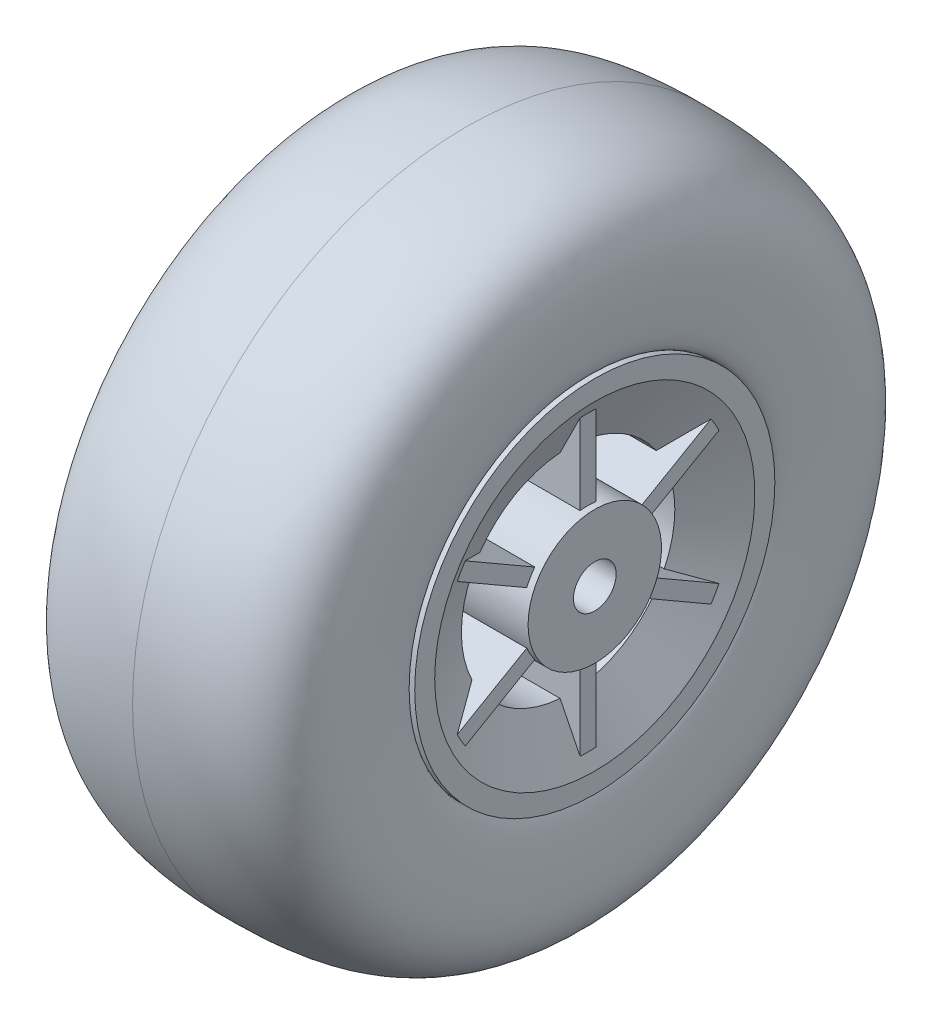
ISO-10303-21;
HEADER;
FILE_DESCRIPTION(('STEP AP214'),'2;1');
FILE_NAME('part.step','',(''),(''),'','','');
FILE_SCHEMA(('AUTOMOTIVE_DESIGN { 1 0 10303 214 1 1 1 1 }'));
ENDSEC;
DATA;
#1=APPLICATION_CONTEXT('core data for automotive mechanical design processes');
#2=APPLICATION_PROTOCOL_DEFINITION('international standard','automotive_design',2000,#1);
#3=PRODUCT_CONTEXT('',#1,'mechanical');
#4=PRODUCT('Part','Part','',(#3));
#5=PRODUCT_RELATED_PRODUCT_CATEGORY('part','',(#4));
#6=PRODUCT_DEFINITION_FORMATION('','',#4);
#7=PRODUCT_DEFINITION_CONTEXT('part definition',#1,'design');
#8=PRODUCT_DEFINITION('design','',#6,#7);
#9=PRODUCT_DEFINITION_SHAPE('','',#8);
#10=(LENGTH_UNIT() NAMED_UNIT(*) SI_UNIT(.MILLI.,.METRE.));
#11=(NAMED_UNIT(*) PLANE_ANGLE_UNIT() SI_UNIT($,.RADIAN.));
#12=(NAMED_UNIT(*) SI_UNIT($,.STERADIAN.) SOLID_ANGLE_UNIT());
#13=UNCERTAINTY_MEASURE_WITH_UNIT(LENGTH_MEASURE(1.E-05),#10,'distance_accuracy_value','');
#14=(GEOMETRIC_REPRESENTATION_CONTEXT(3) GLOBAL_UNCERTAINTY_ASSIGNED_CONTEXT((#13)) GLOBAL_UNIT_ASSIGNED_CONTEXT((#10,
#11,#12)) REPRESENTATION_CONTEXT('',''));
#15=CARTESIAN_POINT('',(0.,0.,0.));
#16=DIRECTION('',(0.,0.,1.));
#17=DIRECTION('',(1.,0.,0.));
#18=AXIS2_PLACEMENT_3D('',#15,#16,#17);
#19=CARTESIAN_POINT('',(0.,0.,0.));
#20=DIRECTION('',(-1.,0.,0.));
#21=DIRECTION('',(0.,0.,1.));
#22=AXIS2_PLACEMENT_3D('',#19,#20,#21);
#23=CYLINDRICAL_SURFACE('',#22,13.5);
#24=CARTESIAN_POINT('',(9.65,0.,0.));
#25=DIRECTION('',(-1.,0.,0.));
#26=DIRECTION('',(0.,0.,1.));
#27=AXIS2_PLACEMENT_3D('',#24,#25,#26);
#28=CIRCLE('',#27,13.5);
#29=CARTESIAN_POINT('',(9.65,0.,13.5));
#30=VERTEX_POINT('',#29);
#31=EDGE_CURVE('E38',#30,#30,#28,.T.);
#32=ORIENTED_EDGE('',*,*,#31,.T.);
#33=EDGE_LOOP('',(#32));
#34=FACE_BOUND('',#33,.T.);
#35=CARTESIAN_POINT('',(9.14548358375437,0.,0.));
#36=DIRECTION('',(-1.,0.,0.));
#37=DIRECTION('',(0.,0.,1.));
#38=AXIS2_PLACEMENT_3D('',#35,#36,#37);
#39=CIRCLE('',#38,13.5);
#40=CARTESIAN_POINT('',(9.14548358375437,0.,13.5));
#41=VERTEX_POINT('',#40);
#42=EDGE_CURVE('E11',#41,#41,#39,.T.);
#43=ORIENTED_EDGE('',*,*,#42,.F.);
#44=EDGE_LOOP('',(#43));
#45=FACE_BOUND('',#44,.T.);
#46=ADVANCED_FACE('F35',(#34,#45),#23,.T.);
#47=CARTESIAN_POINT('',(0.,0.,0.));
#48=DIRECTION('',(-1.,0.,0.));
#49=DIRECTION('',(0.,0.,1.));
#50=AXIS2_PLACEMENT_3D('',#47,#48,#49);
#51=CYLINDRICAL_SURFACE('',#50,13.5);
#52=CARTESIAN_POINT('',(-9.65,0.,0.));
#53=DIRECTION('',(-1.,0.,0.));
#54=DIRECTION('',(0.,0.,1.));
#55=AXIS2_PLACEMENT_3D('',#52,#53,#54);
#56=CIRCLE('',#55,13.5);
#57=CARTESIAN_POINT('',(-9.65,0.,13.5));
#58=VERTEX_POINT('',#57);
#59=EDGE_CURVE('E674',#58,#58,#56,.T.);
#60=ORIENTED_EDGE('',*,*,#59,.F.);
#61=EDGE_LOOP('',(#60));
#62=FACE_BOUND('',#61,.T.);
#63=CARTESIAN_POINT('',(-9.1454835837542,0.,0.));
#64=DIRECTION('',(-1.,0.,0.));
#65=DIRECTION('',(0.,0.,1.));
#66=AXIS2_PLACEMENT_3D('',#63,#64,#65);
#67=CIRCLE('',#66,13.5);
#68=CARTESIAN_POINT('',(-9.1454835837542,0.,13.5));
#69=VERTEX_POINT('',#68);
#70=EDGE_CURVE('E43',#69,#69,#67,.F.);
#71=ORIENTED_EDGE('',*,*,#70,.F.);
#72=EDGE_LOOP('',(#71));
#73=FACE_BOUND('',#72,.T.);
#74=ADVANCED_FACE('F433',(#62,#73),#51,.T.);
#75=CARTESIAN_POINT('',(0.,0.,0.));
#76=DIRECTION('',(-1.,0.,0.));
#77=DIRECTION('',(0.,0.,1.));
#78=AXIS2_PLACEMENT_3D('',#75,#76,#77);
#79=CYLINDRICAL_SURFACE('',#78,8.);
#80=CARTESIAN_POINT('',(7.65,0.,0.));
#81=DIRECTION('',(-1.,0.,0.));
#82=DIRECTION('',(0.,0.,1.));
#83=AXIS2_PLACEMENT_3D('',#80,#81,#82);
#84=CIRCLE('',#83,8.);
#85=CARTESIAN_POINT('',(7.65,4.50834937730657,6.6086901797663));
#86=VERTEX_POINT('',#85);
#87=CARTESIAN_POINT('',(7.65,7.97746827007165,0.599999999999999));
#88=VERTEX_POINT('',#87);
#89=EDGE_CURVE('E543',#86,#88,#84,.T.);
#90=ORIENTED_EDGE('',*,*,#89,.F.);
#91=DIRECTION('',(-1.,0.,0.));
#92=VECTOR('',#91,1.);
#93=CARTESIAN_POINT('',(0.,4.50834937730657,6.6086901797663));
#94=LINE('',#93,#92);
#95=CARTESIAN_POINT('',(3.65,4.50834937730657,6.6086901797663));
#96=VERTEX_POINT('',#95);
#97=EDGE_CURVE('E260',#96,#86,#94,.F.);
#98=ORIENTED_EDGE('',*,*,#97,.F.);
#99=CARTESIAN_POINT('',(3.65,0.,0.));
#100=DIRECTION('',(-1.,0.,0.));
#101=DIRECTION('',(0.,0.,1.));
#102=AXIS2_PLACEMENT_3D('',#99,#100,#101);
#103=CIRCLE('',#102,8.);
#104=CARTESIAN_POINT('',(3.65,7.97746827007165,0.599999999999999));
#105=VERTEX_POINT('',#104);
#106=EDGE_CURVE('E557',#96,#105,#103,.T.);
#107=ORIENTED_EDGE('',*,*,#106,.T.);
#108=DIRECTION('',(-1.,0.,0.));
#109=VECTOR('',#108,1.);
#110=CARTESIAN_POINT('',(0.,7.97746827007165,0.599999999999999));
#111=LINE('',#110,#109);
#112=EDGE_CURVE('E549',#88,#105,#111,.T.);
#113=ORIENTED_EDGE('',*,*,#112,.F.);
#114=EDGE_LOOP('',(#90,#98,#107,#113));
#115=FACE_BOUND('',#114,.T.);
#116=ADVANCED_FACE('F437',(#115),#79,.F.);
#117=CARTESIAN_POINT('',(3.65,8.,0.));
#118=DIRECTION('',(-1.,0.,0.));
#119=DIRECTION('',(0.,0.,1.));
#120=AXIS2_PLACEMENT_3D('',#117,#118,#119);
#121=PLANE('',#120);
#122=ORIENTED_EDGE('',*,*,#106,.F.);
#123=DIRECTION('',(0.,0.50000000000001,0.866025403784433));
#124=VECTOR('',#123,1.);
#125=CARTESIAN_POINT('',(3.64999999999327,6.51961524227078,10.0923048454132));
#126=LINE('',#125,#124);
#127=CARTESIAN_POINT('',(3.64999999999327,3.00154997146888,3.9988370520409));
#128=VERTEX_POINT('',#127);
#129=EDGE_CURVE('E256',#128,#96,#126,.T.);
#130=ORIENTED_EDGE('',*,*,#129,.F.);
#131=CARTESIAN_POINT('',(3.65,0.,0.));
#132=DIRECTION('',(-1.,0.,0.));
#133=DIRECTION('',(0.,0.,1.));
#134=AXIS2_PLACEMENT_3D('',#131,#132,#133);
#135=CIRCLE('',#134,5.);
#136=CARTESIAN_POINT('',(3.64999999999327,4.96386945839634,0.599999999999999));
#137=VERTEX_POINT('',#136);
#138=EDGE_CURVE('E711',#128,#137,#135,.T.);
#139=ORIENTED_EDGE('',*,*,#138,.T.);
#140=DIRECTION('',(0.,-1.,0.));
#141=VECTOR('',#140,1.);
#142=CARTESIAN_POINT('',(3.64999999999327,12.,0.6));
#143=LINE('',#142,#141);
#144=EDGE_CURVE('E675',#105,#137,#143,.T.);
#145=ORIENTED_EDGE('',*,*,#144,.F.);
#146=EDGE_LOOP('',(#122,#130,#139,#145));
#147=FACE_BOUND('',#146,.T.);
#148=ADVANCED_FACE('F479',(#147),#121,.F.);
#149=CARTESIAN_POINT('',(3.65,-3.4691188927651,7.20869017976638));
#150=VERTEX_POINT('',#149);
#151=CARTESIAN_POINT('',(3.65,3.46911889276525,7.20869017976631));
#152=VERTEX_POINT('',#151);
#153=EDGE_CURVE('E716',#150,#152,#103,.T.);
#154=ORIENTED_EDGE('',*,*,#153,.T.);
#155=DIRECTION('',(-1.,0.,0.));
#156=VECTOR('',#155,1.);
#157=CARTESIAN_POINT('',(0.,3.46911889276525,7.20869017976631));
#158=LINE('',#157,#156);
#159=CARTESIAN_POINT('',(7.65,3.46911889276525,7.20869017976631));
#160=VERTEX_POINT('',#159);
#161=EDGE_CURVE('E255',#160,#152,#158,.T.);
#162=ORIENTED_EDGE('',*,*,#161,.F.);
#163=CARTESIAN_POINT('',(7.65,-3.4691188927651,7.20869017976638));
#164=VERTEX_POINT('',#163);
#165=EDGE_CURVE('E254',#164,#160,#84,.T.);
#166=ORIENTED_EDGE('',*,*,#165,.F.);
#167=DIRECTION('',(-1.,0.,0.));
#168=VECTOR('',#167,1.);
#169=CARTESIAN_POINT('',(0.,-3.4691188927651,7.20869017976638));
#170=LINE('',#169,#168);
#171=EDGE_CURVE('E299',#150,#164,#170,.F.);
#172=ORIENTED_EDGE('',*,*,#171,.F.);
#173=EDGE_LOOP('',(#154,#162,#166,#172));
#174=FACE_BOUND('',#173,.T.);
#175=ADVANCED_FACE('F760',(#174),#79,.F.);
#176=CARTESIAN_POINT('',(3.64999999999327,-1.96231948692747,4.59883705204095));
#177=VERTEX_POINT('',#176);
#178=CARTESIAN_POINT('',(3.64999999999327,1.96231948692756,4.59883705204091));
#179=VERTEX_POINT('',#178);
#180=EDGE_CURVE('E719',#177,#179,#135,.T.);
#181=ORIENTED_EDGE('',*,*,#180,.T.);
#182=DIRECTION('',(0.,-0.50000000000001,-0.866025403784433));
#183=VECTOR('',#182,1.);
#184=CARTESIAN_POINT('',(3.64999999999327,5.48038475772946,10.6923048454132));
#185=LINE('',#184,#183);
#186=EDGE_CURVE('E258',#152,#179,#185,.T.);
#187=ORIENTED_EDGE('',*,*,#186,.F.);
#188=ORIENTED_EDGE('',*,*,#153,.F.);
#189=DIRECTION('',(0.,-0.499999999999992,0.866025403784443));
#190=VECTOR('',#189,1.);
#191=CARTESIAN_POINT('',(3.64999999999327,-5.48038475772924,10.6923048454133));
#192=LINE('',#191,#190);
#193=EDGE_CURVE('E301',#177,#150,#192,.T.);
#194=ORIENTED_EDGE('',*,*,#193,.F.);
#195=EDGE_LOOP('',(#181,#187,#188,#194));
#196=FACE_BOUND('',#195,.T.);
#197=ADVANCED_FACE('F761',(#196),#121,.F.);
#198=CARTESIAN_POINT('',(3.65,-7.97746827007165,0.599999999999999));
#199=VERTEX_POINT('',#198);
#200=CARTESIAN_POINT('',(3.65,-4.50834937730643,6.60869017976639));
#201=VERTEX_POINT('',#200);
#202=EDGE_CURVE('E587',#199,#201,#103,.T.);
#203=ORIENTED_EDGE('',*,*,#202,.T.);
#204=DIRECTION('',(-1.,0.,0.));
#205=VECTOR('',#204,1.);
#206=CARTESIAN_POINT('',(0.,-4.50834937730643,6.60869017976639));
#207=LINE('',#206,#205);
#208=CARTESIAN_POINT('',(7.65,-4.50834937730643,6.60869017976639));
#209=VERTEX_POINT('',#208);
#210=EDGE_CURVE('E586',#209,#201,#207,.T.);
#211=ORIENTED_EDGE('',*,*,#210,.F.);
#212=CARTESIAN_POINT('',(7.65,-7.97746827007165,0.599999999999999));
#213=VERTEX_POINT('',#212);
#214=EDGE_CURVE('E553',#213,#209,#84,.T.);
#215=ORIENTED_EDGE('',*,*,#214,.F.);
#216=DIRECTION('',(-1.,0.,0.));
#217=VECTOR('',#216,1.);
#218=CARTESIAN_POINT('',(0.,-7.97746827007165,0.599999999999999));
#219=LINE('',#218,#217);
#220=EDGE_CURVE('E330',#199,#213,#219,.F.);
#221=ORIENTED_EDGE('',*,*,#220,.F.);
#222=EDGE_LOOP('',(#203,#211,#215,#221));
#223=FACE_BOUND('',#222,.T.);
#224=ADVANCED_FACE('F584',(#223),#79,.F.);
#225=CARTESIAN_POINT('',(3.64999999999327,-4.96386945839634,0.599999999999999));
#226=VERTEX_POINT('',#225);
#227=CARTESIAN_POINT('',(3.64999999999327,-3.0015499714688,3.99883705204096));
#228=VERTEX_POINT('',#227);
#229=EDGE_CURVE('E724',#226,#228,#135,.T.);
#230=ORIENTED_EDGE('',*,*,#229,.T.);
#231=DIRECTION('',(0.,0.499999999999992,-0.866025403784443));
#232=VECTOR('',#231,1.);
#233=CARTESIAN_POINT('',(3.64999999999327,-6.51961524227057,10.0923048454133));
#234=LINE('',#233,#232);
#235=EDGE_CURVE('E590',#201,#228,#234,.T.);
#236=ORIENTED_EDGE('',*,*,#235,.F.);
#237=ORIENTED_EDGE('',*,*,#202,.F.);
#238=DIRECTION('',(0.,-1.,0.));
#239=VECTOR('',#238,1.);
#240=CARTESIAN_POINT('',(3.64999999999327,-12.,0.6));
#241=LINE('',#240,#239);
#242=EDGE_CURVE('E332',#226,#199,#241,.T.);
#243=ORIENTED_EDGE('',*,*,#242,.F.);
#244=EDGE_LOOP('',(#230,#236,#237,#243));
#245=FACE_BOUND('',#244,.T.);
#246=ADVANCED_FACE('F773',(#245),#121,.F.);
#247=CARTESIAN_POINT('',(3.65,-4.50834937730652,-6.60869017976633));
#248=VERTEX_POINT('',#247);
#249=CARTESIAN_POINT('',(3.65,-7.97746827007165,-0.599999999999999));
#250=VERTEX_POINT('',#249);
#251=EDGE_CURVE('E762',#248,#250,#103,.T.);
#252=ORIENTED_EDGE('',*,*,#251,.T.);
#253=DIRECTION('',(-1.,0.,0.));
#254=VECTOR('',#253,1.);
#255=CARTESIAN_POINT('',(0.,-7.97746827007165,-0.599999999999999));
#256=LINE('',#255,#254);
#257=CARTESIAN_POINT('',(7.65,-7.97746827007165,-0.599999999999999));
#258=VERTEX_POINT('',#257);
#259=EDGE_CURVE('E610',#258,#250,#256,.T.);
#260=ORIENTED_EDGE('',*,*,#259,.F.);
#261=CARTESIAN_POINT('',(7.65,-4.50834937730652,-6.60869017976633));
#262=VERTEX_POINT('',#261);
#263=EDGE_CURVE('E566',#262,#258,#84,.T.);
#264=ORIENTED_EDGE('',*,*,#263,.F.);
#265=DIRECTION('',(-1.,0.,0.));
#266=VECTOR('',#265,1.);
#267=CARTESIAN_POINT('',(0.,-4.50834937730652,-6.60869017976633));
#268=LINE('',#267,#266);
#269=EDGE_CURVE('E361',#248,#262,#268,.F.);
#270=ORIENTED_EDGE('',*,*,#269,.F.);
#271=EDGE_LOOP('',(#252,#260,#264,#270));
#272=FACE_BOUND('',#271,.T.);
#273=ADVANCED_FACE('F771',(#272),#79,.F.);
#274=CARTESIAN_POINT('',(3.64999999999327,-3.00154997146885,-3.99883705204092));
#275=VERTEX_POINT('',#274);
#276=CARTESIAN_POINT('',(3.64999999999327,-4.96386945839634,-0.599999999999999));
#277=VERTEX_POINT('',#276);
#278=EDGE_CURVE('E718',#275,#277,#135,.T.);
#279=ORIENTED_EDGE('',*,*,#278,.T.);
#280=DIRECTION('',(0.,1.,0.));
#281=VECTOR('',#280,1.);
#282=CARTESIAN_POINT('',(3.64999999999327,-12.,-0.6));
#283=LINE('',#282,#281);
#284=EDGE_CURVE('E607',#250,#277,#283,.T.);
#285=ORIENTED_EDGE('',*,*,#284,.F.);
#286=ORIENTED_EDGE('',*,*,#251,.F.);
#287=DIRECTION('',(0.,-0.500000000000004,-0.866025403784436));
#288=VECTOR('',#287,1.);
#289=CARTESIAN_POINT('',(3.64999999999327,-6.51961524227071,-10.0923048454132));
#290=LINE('',#289,#288);
#291=EDGE_CURVE('E363',#275,#248,#290,.T.);
#292=ORIENTED_EDGE('',*,*,#291,.F.);
#293=EDGE_LOOP('',(#279,#285,#286,#292));
#294=FACE_BOUND('',#293,.T.);
#295=ADVANCED_FACE('F494',(#294),#121,.F.);
#296=CARTESIAN_POINT('',(3.65,3.46911889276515,-7.20869017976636));
#297=VERTEX_POINT('',#296);
#298=CARTESIAN_POINT('',(3.65,-3.4691188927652,-7.20869017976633));
#299=VERTEX_POINT('',#298);
#300=EDGE_CURVE('E555',#297,#299,#103,.T.);
#301=ORIENTED_EDGE('',*,*,#300,.T.);
#302=DIRECTION('',(-1.,0.,0.));
#303=VECTOR('',#302,1.);
#304=CARTESIAN_POINT('',(0.,-3.4691188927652,-7.20869017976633));
#305=LINE('',#304,#303);
#306=CARTESIAN_POINT('',(7.65,-3.4691188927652,-7.20869017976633));
#307=VERTEX_POINT('',#306);
#308=EDGE_CURVE('E633',#307,#299,#305,.T.);
#309=ORIENTED_EDGE('',*,*,#308,.F.);
#310=CARTESIAN_POINT('',(7.65,3.46911889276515,-7.20869017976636));
#311=VERTEX_POINT('',#310);
#312=EDGE_CURVE('E560',#311,#307,#84,.T.);
#313=ORIENTED_EDGE('',*,*,#312,.F.);
#314=DIRECTION('',(-1.,0.,0.));
#315=VECTOR('',#314,1.);
#316=CARTESIAN_POINT('',(0.,3.46911889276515,-7.20869017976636));
#317=LINE('',#316,#315);
#318=EDGE_CURVE('E392',#297,#311,#317,.F.);
#319=ORIENTED_EDGE('',*,*,#318,.F.);
#320=EDGE_LOOP('',(#301,#309,#313,#319));
#321=FACE_BOUND('',#320,.T.);
#322=ADVANCED_FACE('F484',(#321),#79,.F.);
#323=CARTESIAN_POINT('',(3.64999999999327,1.9623194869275,-4.59883705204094));
#324=VERTEX_POINT('',#323);
#325=CARTESIAN_POINT('',(3.64999999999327,-1.96231948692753,-4.59883705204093));
#326=VERTEX_POINT('',#325);
#327=EDGE_CURVE('E714',#324,#326,#135,.T.);
#328=ORIENTED_EDGE('',*,*,#327,.T.);
#329=DIRECTION('',(0.,0.500000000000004,0.866025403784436));
#330=VECTOR('',#329,1.);
#331=CARTESIAN_POINT('',(3.64999999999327,-5.48038475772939,-10.6923048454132));
#332=LINE('',#331,#330);
#333=EDGE_CURVE('E629',#299,#326,#332,.T.);
#334=ORIENTED_EDGE('',*,*,#333,.F.);
#335=ORIENTED_EDGE('',*,*,#300,.F.);
#336=DIRECTION('',(0.,0.499999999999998,-0.86602540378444));
#337=VECTOR('',#336,1.);
#338=CARTESIAN_POINT('',(3.64999999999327,5.48038475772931,-10.6923048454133));
#339=LINE('',#338,#337);
#340=EDGE_CURVE('E394',#324,#297,#339,.T.);
#341=ORIENTED_EDGE('',*,*,#340,.F.);
#342=EDGE_LOOP('',(#328,#334,#335,#341));
#343=FACE_BOUND('',#342,.T.);
#344=ADVANCED_FACE('F480',(#343),#121,.F.);
#345=CARTESIAN_POINT('',(9.65,13.5,0.));
#346=DIRECTION('',(-1.,0.,0.));
#347=DIRECTION('',(0.,0.,1.));
#348=AXIS2_PLACEMENT_3D('',#345,#346,#347);
#349=PLANE('',#348);
#350=ORIENTED_EDGE('',*,*,#31,.F.);
#351=EDGE_LOOP('',(#350));
#352=FACE_BOUND('',#351,.T.);
#353=CARTESIAN_POINT('',(9.65,0.,0.));
#354=DIRECTION('',(-1.,0.,0.));
#355=DIRECTION('',(0.,0.,1.));
#356=AXIS2_PLACEMENT_3D('',#353,#354,#355);
#357=CIRCLE('',#356,12.);
#358=CARTESIAN_POINT('',(9.65,0.,12.));
#359=VERTEX_POINT('',#358);
#360=EDGE_CURVE('E559',#359,#359,#357,.T.);
#361=ORIENTED_EDGE('',*,*,#360,.T.);
#362=EDGE_LOOP('',(#361));
#363=FACE_BOUND('',#362,.T.);
#364=ADVANCED_FACE('F486',(#352,#363),#349,.F.);
#365=CARTESIAN_POINT('',(7.65,0.,0.));
#366=DIRECTION('',(1.,0.,0.));
#367=DIRECTION('',(0.,0.,-1.));
#368=AXIS2_PLACEMENT_3D('',#365,#366,#367);
#369=CONICAL_SURFACE('',#368,8.,1.10714871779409);
#370=ORIENTED_EDGE('',*,*,#360,.F.);
#371=EDGE_LOOP('',(#370));
#372=FACE_BOUND('',#371,.T.);
#373=CARTESIAN_POINT('',(9.15,0.,0.));
#374=DIRECTION('',(1.,0.,0.));
#375=DIRECTION('',(0.,0.,-1.));
#376=AXIS2_PLACEMENT_3D('',#373,#374,#375);
#377=CIRCLE('',#376,11.);
#378=CARTESIAN_POINT('',(9.15,6.01142732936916,9.21209756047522));
#379=VERTEX_POINT('',#378);
#380=CARTESIAN_POINT('',(9.15,4.97219684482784,9.81209756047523));
#381=VERTEX_POINT('',#380);
#382=EDGE_CURVE('E232',#379,#381,#377,.T.);
#383=ORIENTED_EDGE('',*,*,#382,.F.);
#384=CARTESIAN_POINT('',(3.95017812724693,0.509275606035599,-0.317908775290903));
#385=CARTESIAN_POINT('',(3.94984221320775,0.518891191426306,-0.301254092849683));
#386=CARTESIAN_POINT('',(3.94997746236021,0.528509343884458,-0.28459496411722));
#387=CARTESIAN_POINT('',(3.95116270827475,0.547727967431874,-0.251307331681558));
#388=CARTESIAN_POINT('',(3.95221235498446,0.557328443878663,-0.234678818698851));
#389=CARTESIAN_POINT('',(3.95667856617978,0.585995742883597,-0.185025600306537));
#390=CARTESIAN_POINT('',(3.96140996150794,0.605013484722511,-0.152085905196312));
#391=CARTESIAN_POINT('',(3.97375497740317,0.642626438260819,-0.0869383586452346));
#392=CARTESIAN_POINT('',(3.98134233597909,0.661223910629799,-0.0547265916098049));
#393=CARTESIAN_POINT('',(3.9987366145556,0.698174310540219,0.0092733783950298));
#394=CARTESIAN_POINT('',(4.00854607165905,0.716526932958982,0.0410610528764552));
#395=CARTESIAN_POINT('',(4.03086638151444,0.754829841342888,0.107403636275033));
#396=CARTESIAN_POINT('',(4.04354991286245,0.774754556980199,0.141914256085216));
#397=CARTESIAN_POINT('',(4.0703188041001,0.814368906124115,0.210528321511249));
#398=CARTESIAN_POINT('',(4.08440448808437,0.834058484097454,0.244631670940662));
#399=CARTESIAN_POINT('',(4.12815645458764,0.892884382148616,0.34652111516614));
#400=CARTESIAN_POINT('',(4.15929659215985,0.931744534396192,0.413828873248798));
#401=CARTESIAN_POINT('',(4.22372014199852,1.00910959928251,0.547829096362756));
#402=CARTESIAN_POINT('',(4.2570082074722,1.04761351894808,0.614519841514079));
#403=CARTESIAN_POINT('',(4.3248017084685,1.12432904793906,0.747395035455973));
#404=CARTESIAN_POINT('',(4.35930652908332,1.16254079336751,0.81357971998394));
#405=CARTESIAN_POINT('',(4.42970239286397,1.23946171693,0.946810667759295));
#406=CARTESIAN_POINT('',(4.46560716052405,1.27816773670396,1.01385146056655));
#407=CARTESIAN_POINT('',(4.537949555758,1.3554609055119,1.14772715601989));
#408=CARTESIAN_POINT('',(4.57438725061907,1.39404803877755,1.21456203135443));
#409=CARTESIAN_POINT('',(4.68412127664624,1.50956107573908,1.41463648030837));
#410=CARTESIAN_POINT('',(4.7579511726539,1.58636006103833,1.54765622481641));
#411=CARTESIAN_POINT('',(4.90542394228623,1.73881492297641,1.81171579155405));
#412=CARTESIAN_POINT('',(4.97905753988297,1.81447305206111,1.94275951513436));
#413=CARTESIAN_POINT('',(5.12676882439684,1.96568092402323,2.20465923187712));
#414=CARTESIAN_POINT('',(5.20084651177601,2.04123066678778,2.33551522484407));
#415=CARTESIAN_POINT('',(5.42349768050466,2.26778130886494,2.72791244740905));
#416=CARTESIAN_POINT('',(5.57248593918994,2.41868020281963,2.98927699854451));
#417=CARTESIAN_POINT('',(5.87107202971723,2.7204371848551,3.51193542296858));
#418=CARTESIAN_POINT('',(6.02067016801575,2.87129519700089,3.77322916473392));
#419=CARTESIAN_POINT('',(6.32016567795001,3.17293539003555,4.29568530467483));
#420=CARTESIAN_POINT('',(6.47006304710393,3.32371757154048,4.55684770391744));
#421=CARTESIAN_POINT('',(6.76852968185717,3.62371768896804,5.07646314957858));
#422=CARTESIAN_POINT('',(6.91709711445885,3.77293608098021,5.33491698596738));
#423=CARTESIAN_POINT('',(7.21435168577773,4.07134346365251,5.85177373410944));
#424=CARTESIAN_POINT('',(7.36303882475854,4.22053245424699,6.11017664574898));
#425=CARTESIAN_POINT('',(7.80917145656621,4.66801877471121,6.88524568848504));
#426=CARTESIAN_POINT('',(8.10673833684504,4.96628584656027,7.4018594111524));
#427=CARTESIAN_POINT('',(8.71449984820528,5.57525890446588,8.45663168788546));
#428=CARTESIAN_POINT('',(9.02470178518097,5.88596306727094,8.99478708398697));
#429=CARTESIAN_POINT('',(9.64523443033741,6.50736137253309,10.0710805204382));
#430=CARTESIAN_POINT('',(9.95556514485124,6.81805551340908,10.6092185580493));
#431=CARTESIAN_POINT('',(10.5794894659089,7.44262234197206,11.6910000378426));
#432=CARTESIAN_POINT('',(10.8930837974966,7.75649484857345,12.2346431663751));
#433=CARTESIAN_POINT('',(11.5203045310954,8.38420929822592,13.3218764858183));
#434=CARTESIAN_POINT('',(11.8339309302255,8.69805124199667,13.8654666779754));
#435=CARTESIAN_POINT('',(12.1475716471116,9.01188960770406,14.409050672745));
#436=B_SPLINE_CURVE_WITH_KNOTS('',3,(#384,#385,#386,#387,#388,#389,#390,#391,#392,#393,#394,
#395,#396,#397,#398,#399,#400,#401,#402,#403,#404,#405,#406,#407,#408,#409,#410,#411,#412,#413,
#414,#415,#416,#417,#418,#419,#420,#421,#422,#423,#424,#425,#426,#427,#428,#429,#430,#431,#432,
#433,#434,#435),.UNSPECIFIED.,.F.,.F.,(4,2,2,2,2,2,2,2,2,2,2,2,2,2,2,2,2,2,2,2,2,2,2,2,2,4),(0.,
0.0576911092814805,0.115360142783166,0.230189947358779,0.343988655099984,0.457917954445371,
0.583338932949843,0.708788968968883,0.959898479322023,1.2115715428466,1.46311919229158,
1.71911675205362,1.97514691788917,2.48640410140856,2.99124661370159,3.49608965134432,
4.50579854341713,5.51610007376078,6.52639325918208,7.52650880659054,8.52662656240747,
10.5265243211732,12.6101178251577,14.6938301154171,16.7989778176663,18.904004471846),.UNSPECIFIED.);
#437=EDGE_CURVE('E268',#86,#379,#436,.T.);
#438=ORIENTED_EDGE('',*,*,#437,.F.);
#439=ORIENTED_EDGE('',*,*,#89,.T.);
#440=CARTESIAN_POINT('',(11.4217669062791,15.5319491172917,0.6));
#441=CARTESIAN_POINT('',(10.792742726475,14.2728636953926,0.6));
#442=CARTESIAN_POINT('',(10.1637271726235,13.0137738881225,0.6));
#443=CARTESIAN_POINT('',(9.22054290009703,11.1249711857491,0.6));
#444=CARTESIAN_POINT('',(8.9062049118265,10.4953428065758,0.6));
#445=CARTESIAN_POINT('',(8.27769597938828,9.23600249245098,0.6));
#446=CARTESIAN_POINT('',(7.96352503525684,8.60629055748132,0.599999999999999));
#447=CARTESIAN_POINT('',(7.45108767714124,7.57851926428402,0.599999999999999));
#448=CARTESIAN_POINT('',(7.25272392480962,7.18050844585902,0.599999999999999));
#449=CARTESIAN_POINT('',(6.85620840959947,6.38438145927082,0.599999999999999));
#450=CARTESIAN_POINT('',(6.65805664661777,5.98626529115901,0.599999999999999));
#451=CARTESIAN_POINT('',(6.26212004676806,5.18984961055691,0.599999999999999));
#452=CARTESIAN_POINT('',(6.06433521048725,4.79155009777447,0.599999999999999));
#453=CARTESIAN_POINT('',(5.76821927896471,4.19382218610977,0.599999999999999));
#454=CARTESIAN_POINT('',(5.66960744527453,3.99453295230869,0.599999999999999));
#455=CARTESIAN_POINT('',(5.47269528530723,3.59580044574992,0.599999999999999));
#456=CARTESIAN_POINT('',(5.37439495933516,3.39635717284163,0.599999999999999));
#457=CARTESIAN_POINT('',(5.2763126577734,3.19680644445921,0.599999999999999));
#458=B_SPLINE_CURVE_WITH_KNOTS('',3,(#440,#441,#442,#443,#444,#445,#446,#447,#448,#449,#450,
#451,#452,#453,#454,#455,#456,#457),.UNSPECIFIED.,.F.,.F.,(4,2,2,2,2,2,2,2,4),(0.,
4.22240552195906,6.33360479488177,8.44480452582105,9.77891358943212,11.1130220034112,
12.4471325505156,13.1141888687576,13.7812458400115),.UNSPECIFIED.);
#459=CARTESIAN_POINT('',(9.15,10.9836241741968,0.6));
#460=VERTEX_POINT('',#459);
#461=EDGE_CURVE('E426',#460,#88,#458,.T.);
#462=ORIENTED_EDGE('',*,*,#461,.F.);
#463=CARTESIAN_POINT('',(9.15,0.,0.));
#464=DIRECTION('',(1.,0.,0.));
#465=DIRECTION('',(0.,0.,-1.));
#466=AXIS2_PLACEMENT_3D('',#463,#464,#465);
#467=CIRCLE('',#466,11.);
#468=CARTESIAN_POINT('',(9.15,10.9836241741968,-0.6));
#469=VERTEX_POINT('',#468);
#470=EDGE_CURVE('E670',#469,#460,#467,.T.);
#471=ORIENTED_EDGE('',*,*,#470,.F.);
#472=CARTESIAN_POINT('',(5.2763126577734,3.19680644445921,-0.599999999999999));
#473=CARTESIAN_POINT('',(5.40255851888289,3.45361283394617,-0.599999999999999));
#474=CARTESIAN_POINT('',(5.52913991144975,3.71025371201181,-0.599999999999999));
#475=CARTESIAN_POINT('',(5.78276137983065,4.22330840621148,-0.599999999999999));
#476=CARTESIAN_POINT('',(5.90980145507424,4.47972222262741,-0.599999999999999));
#477=CARTESIAN_POINT('',(6.16412800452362,4.99242694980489,-0.599999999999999));
#478=CARTESIAN_POINT('',(6.29141447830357,5.24871786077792,-0.599999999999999));
#479=CARTESIAN_POINT('',(6.54615412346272,5.76121692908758,-0.599999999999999));
#480=CARTESIAN_POINT('',(6.67360729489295,6.01742508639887,-0.599999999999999));
#481=CARTESIAN_POINT('',(6.94240643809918,6.55747545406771,-0.599999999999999));
#482=CARTESIAN_POINT('',(7.08376505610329,6.84131136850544,-0.599999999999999));
#483=CARTESIAN_POINT('',(7.36657685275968,7.40893626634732,-0.599999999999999));
#484=CARTESIAN_POINT('',(7.50803003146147,7.6927252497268,-0.599999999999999));
#485=CARTESIAN_POINT('',(7.96352509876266,8.60629200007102,-0.599999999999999));
#486=CARTESIAN_POINT('',(8.27769625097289,9.23600531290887,-0.6));
#487=CARTESIAN_POINT('',(8.9062082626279,10.4953472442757,-0.6));
#488=CARTESIAN_POINT('',(9.22054912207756,11.1249758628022,-0.6));
#489=CARTESIAN_POINT('',(9.8493322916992,12.3841805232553,-0.6));
#490=CARTESIAN_POINT('',(10.1637746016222,13.0137565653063,-0.6));
#491=CARTESIAN_POINT('',(10.7927277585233,14.2728743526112,-0.6));
#492=CARTESIAN_POINT('',(11.1072386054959,14.9024160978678,-0.6));
#493=CARTESIAN_POINT('',(11.4217669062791,15.5319491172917,-0.6));
#494=B_SPLINE_CURVE_WITH_KNOTS('',3,(#472,#473,#474,#475,#476,#477,#478,#479,#480,#481,#482,
#483,#484,#485,#486,#487,#488,#489,#490,#491,#492,#493),.UNSPECIFIED.,.F.,.F.,(4,2,2,2,2,2,2,2,
2,2,4),(0.,0.858479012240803,1.71695695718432,2.57543341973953,3.43391014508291,
4.38517547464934,5.33644130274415,7.44764500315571,9.55884876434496,11.6700473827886,
13.7812458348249),.UNSPECIFIED.);
#495=CARTESIAN_POINT('',(7.65,7.97746827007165,-0.599999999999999));
#496=VERTEX_POINT('',#495);
#497=EDGE_CURVE('E416',#496,#469,#494,.T.);
#498=ORIENTED_EDGE('',*,*,#497,.F.);
#499=CARTESIAN_POINT('',(7.65,4.50834937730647,-6.60869017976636));
#500=VERTEX_POINT('',#499);
#501=EDGE_CURVE('E552',#496,#500,#84,.T.);
#502=ORIENTED_EDGE('',*,*,#501,.T.);
#503=CARTESIAN_POINT('',(12.1475716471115,9.01188960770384,-14.4090506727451));
#504=CARTESIAN_POINT('',(11.6382611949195,8.50224532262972,-13.5263208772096));
#505=CARTESIAN_POINT('',(11.1289714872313,7.9925958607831,-12.6435821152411));
#506=CARTESIAN_POINT('',(10.1105278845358,6.97321506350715,-10.8779627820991));
#507=CARTESIAN_POINT('',(9.60137400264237,6.4634837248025,-9.99508220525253));
#508=CARTESIAN_POINT('',(8.59525360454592,5.45584283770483,-8.24979699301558));
#509=CARTESIAN_POINT('',(8.09828000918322,4.95793505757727,-7.38739542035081));
#510=CARTESIAN_POINT('',(7.35344939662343,4.21093891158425,-6.09356014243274));
#511=CARTESIAN_POINT('',(7.10528646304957,3.96192680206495,-5.66225851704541));
#512=CARTESIAN_POINT('',(6.60934053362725,3.46380816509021,-4.79949172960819));
#513=CARTESIAN_POINT('',(6.3615575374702,3.21470163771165,-4.36802656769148));
#514=CARTESIAN_POINT('',(5.97193838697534,2.82215506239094,-3.68811595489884));
#515=CARTESIAN_POINT('',(5.82981539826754,2.67878619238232,-3.43979378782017));
#516=CARTESIAN_POINT('',(5.54604622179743,2.3919015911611,-2.94289508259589));
#517=CARTESIAN_POINT('',(5.40440011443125,2.24838584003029,-2.69431850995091));
#518=CARTESIAN_POINT('',(5.19199486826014,2.03220365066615,-2.31987997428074));
#519=CARTESIAN_POINT('',(5.12085302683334,1.95963124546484,-2.19418088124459));
#520=CARTESIAN_POINT('',(4.97897788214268,1.81438499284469,-1.94260699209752));
#521=CARTESIAN_POINT('',(4.90824458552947,1.74171114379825,-1.81673219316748));
#522=CARTESIAN_POINT('',(4.76748332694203,1.5962327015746,-1.56475613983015));
#523=CARTESIAN_POINT('',(4.69745506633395,1.52342818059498,-1.43865501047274));
#524=CARTESIAN_POINT('',(4.55857773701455,1.37753921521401,-1.18596791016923));
#525=CARTESIAN_POINT('',(4.48972862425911,1.30445478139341,-1.05938195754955));
#526=CARTESIAN_POINT('',(4.38165331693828,1.18714763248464,-0.856200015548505));
#527=CARTESIAN_POINT('',(4.3416250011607,1.1431100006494,-0.779924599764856));
#528=CARTESIAN_POINT('',(4.26305085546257,1.05464502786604,-0.626698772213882));
#529=CARTESIAN_POINT('',(4.22450661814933,1.01021732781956,-0.549747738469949));
#530=CARTESIAN_POINT('',(4.16909844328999,0.943420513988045,-0.434052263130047));
#531=CARTESIAN_POINT('',(4.15114345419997,0.921278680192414,-0.395701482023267));
#532=CARTESIAN_POINT('',(4.11624787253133,0.876796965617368,-0.31865689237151));
#533=CARTESIAN_POINT('',(4.09930717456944,0.854457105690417,-0.279963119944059));
#534=CARTESIAN_POINT('',(4.06691209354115,0.809541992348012,-0.2021678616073));
#535=CARTESIAN_POINT('',(4.05145568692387,0.786967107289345,-0.163067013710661));
#536=CARTESIAN_POINT('',(4.02270938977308,0.741478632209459,-0.0842786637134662));
#537=CARTESIAN_POINT('',(4.00941833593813,0.71856523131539,-0.0445914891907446));
#538=CARTESIAN_POINT('',(3.99008468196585,0.680322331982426,0.0216471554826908));
#539=CARTESIAN_POINT('',(3.98312481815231,0.665109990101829,0.0479957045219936));
#540=CARTESIAN_POINT('',(3.97094422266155,0.634516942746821,0.100984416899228));
#541=CARTESIAN_POINT('',(3.96572257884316,0.619136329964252,0.12762441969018));
#542=CARTESIAN_POINT('',(3.95734554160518,0.588063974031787,0.181443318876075));
#543=CARTESIAN_POINT('',(3.95421272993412,0.572370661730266,0.208624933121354));
#544=CARTESIAN_POINT('',(3.95033533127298,0.540875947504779,0.263175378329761));
#545=CARTESIAN_POINT('',(3.94959620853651,0.525074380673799,0.290544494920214));
#546=CARTESIAN_POINT('',(3.95017812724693,0.509275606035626,0.31790877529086));
#547=B_SPLINE_CURVE_WITH_KNOTS('',3,(#503,#504,#505,#506,#507,#508,#509,#510,#511,#512,#513,
#514,#515,#516,#517,#518,#519,#520,#521,#522,#523,#524,#525,#526,#527,#528,#529,#530,#531,#532,
#533,#534,#535,#536,#537,#538,#539,#540,#541,#542,#543,#544,#545,#546),.UNSPECIFIED.,.F.,.F.,(4,
2,2,2,2,2,2,2,2,2,2,2,2,2,2,2,2,2,2,2,2,4),(0.,3.4183500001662,6.8369573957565,10.1757716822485,
11.8450579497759,13.5143428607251,14.4744246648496,15.4346609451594,15.9195870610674,
16.40452104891,16.8892401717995,17.3739411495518,17.664169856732,17.9547017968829,
18.0980492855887,18.2413818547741,18.384516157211,18.5275733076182,18.6211658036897,
18.7147091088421,18.8092479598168,18.9040024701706),.UNSPECIFIED.);
#548=CARTESIAN_POINT('',(9.15,6.01142732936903,-9.21209756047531));
#549=VERTEX_POINT('',#548);
#550=EDGE_CURVE('E396',#549,#500,#547,.T.);
#551=ORIENTED_EDGE('',*,*,#550,.F.);
#552=CARTESIAN_POINT('',(9.15,0.,0.));
#553=DIRECTION('',(1.,0.,0.));
#554=DIRECTION('',(0.,0.,-1.));
#555=AXIS2_PLACEMENT_3D('',#552,#553,#554);
#556=CIRCLE('',#555,11.);
#557=CARTESIAN_POINT('',(9.15,4.97219684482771,-9.8120975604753));
#558=VERTEX_POINT('',#557);
#559=EDGE_CURVE('E647',#558,#549,#556,.T.);
#560=ORIENTED_EDGE('',*,*,#559,.F.);
#561=CARTESIAN_POINT('',(3.95017812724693,-0.529954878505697,-0.282091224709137));
#562=CARTESIAN_POINT('',(3.94984221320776,-0.52033929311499,-0.298745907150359));
#563=CARTESIAN_POINT('',(3.94997746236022,-0.510721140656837,-0.315405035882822));
#564=CARTESIAN_POINT('',(3.95116270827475,-0.491502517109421,-0.348692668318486));
#565=CARTESIAN_POINT('',(3.95221235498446,-0.481902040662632,-0.365321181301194));
#566=CARTESIAN_POINT('',(3.95667856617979,-0.453234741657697,-0.414974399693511));
#567=CARTESIAN_POINT('',(3.96140996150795,-0.434216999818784,-0.447914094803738));
#568=CARTESIAN_POINT('',(3.97375497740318,-0.396604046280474,-0.513061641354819));
#569=CARTESIAN_POINT('',(3.9813423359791,-0.378006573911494,-0.54527340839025));
#570=CARTESIAN_POINT('',(3.99873661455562,-0.341056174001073,-0.609273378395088));
#571=CARTESIAN_POINT('',(4.00854607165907,-0.322703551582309,-0.641061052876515));
#572=CARTESIAN_POINT('',(4.03086638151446,-0.284400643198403,-0.707403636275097));
#573=CARTESIAN_POINT('',(4.04354991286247,-0.26447592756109,-0.741914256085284));
#574=CARTESIAN_POINT('',(4.07031880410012,-0.224861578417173,-0.810528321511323));
#575=CARTESIAN_POINT('',(4.0844044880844,-0.205172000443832,-0.844631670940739));
#576=CARTESIAN_POINT('',(4.12815645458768,-0.146346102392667,-0.946521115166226));
#577=CARTESIAN_POINT('',(4.15929659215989,-0.10748595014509,-1.01382887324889));
#578=CARTESIAN_POINT('',(4.22372014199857,-0.0301208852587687,-1.14782909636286));
#579=CARTESIAN_POINT('',(4.25700820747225,0.00838303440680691,-1.21451984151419));
#580=CARTESIAN_POINT('',(4.32480170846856,0.0850985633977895,-1.34739503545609));
#581=CARTESIAN_POINT('',(4.35930652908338,0.123310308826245,-1.41357971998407));
#582=CARTESIAN_POINT('',(4.42970239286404,0.200231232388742,-1.54681066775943));
#583=CARTESIAN_POINT('',(4.46560716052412,0.238937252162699,-1.6138514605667));
#584=CARTESIAN_POINT('',(4.53794955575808,0.31623042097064,-1.74772715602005));
#585=CARTESIAN_POINT('',(4.57438725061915,0.354817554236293,-1.81456203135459));
#586=CARTESIAN_POINT('',(4.68412127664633,0.47033059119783,-2.01463648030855));
#587=CARTESIAN_POINT('',(4.757951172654,0.547129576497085,-2.1476562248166));
#588=CARTESIAN_POINT('',(4.90542394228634,0.699584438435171,-2.41171579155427));
#589=CARTESIAN_POINT('',(4.97905753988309,0.77524256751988,-2.54275951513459));
#590=CARTESIAN_POINT('',(5.12676882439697,0.926450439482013,-2.80465923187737));
#591=CARTESIAN_POINT('',(5.20084651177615,1.00200018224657,-2.93551522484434));
#592=CARTESIAN_POINT('',(5.42349768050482,1.22855082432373,-3.32791244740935));
#593=CARTESIAN_POINT('',(5.57248593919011,1.37944971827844,-3.58927699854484));
#594=CARTESIAN_POINT('',(5.87107202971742,1.68120670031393,-4.11193542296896));
#595=CARTESIAN_POINT('',(6.02067016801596,1.83206471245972,-4.37322916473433));
#596=CARTESIAN_POINT('',(6.32016567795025,2.1337049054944,-4.89568530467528));
#597=CARTESIAN_POINT('',(6.47006304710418,2.28448708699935,-5.15684770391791));
#598=CARTESIAN_POINT('',(6.76852968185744,2.58448720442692,-5.67646314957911));
#599=CARTESIAN_POINT('',(6.91709711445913,2.7337055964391,-5.93491698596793));
#600=CARTESIAN_POINT('',(7.21435168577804,3.03211297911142,-6.45177373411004));
#601=CARTESIAN_POINT('',(7.36303882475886,3.18130196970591,-6.71017664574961));
#602=CARTESIAN_POINT('',(7.80917145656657,3.62878829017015,-7.48524568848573));
#603=CARTESIAN_POINT('',(8.10673833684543,3.92705536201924,-8.00185941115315));
#604=CARTESIAN_POINT('',(8.71449984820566,4.53602841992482,-9.0566316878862));
#605=CARTESIAN_POINT('',(9.02470178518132,4.84673258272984,-9.59478708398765));
#606=CARTESIAN_POINT('',(9.64523443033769,5.4681308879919,-10.6710805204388));
#607=CARTESIAN_POINT('',(9.95556514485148,5.77882502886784,-11.2092185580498));
#608=CARTESIAN_POINT('',(10.5794894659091,6.40339185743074,-12.2910000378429));
#609=CARTESIAN_POINT('',(10.8930837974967,6.71726436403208,-12.8346431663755));
#610=CARTESIAN_POINT('',(11.5203045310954,7.34497881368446,-13.9218764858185));
#611=CARTESIAN_POINT('',(11.8339309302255,7.65882075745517,-14.4654666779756));
#612=CARTESIAN_POINT('',(12.1475716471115,7.97265912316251,-15.0090506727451));
#613=B_SPLINE_CURVE_WITH_KNOTS('',3,(#561,#562,#563,#564,#565,#566,#567,#568,#569,#570,#571,
#572,#573,#574,#575,#576,#577,#578,#579,#580,#581,#582,#583,#584,#585,#586,#587,#588,#589,#590,
#591,#592,#593,#594,#595,#596,#597,#598,#599,#600,#601,#602,#603,#604,#605,#606,#607,#608,#609,
#610,#611,#612),.UNSPECIFIED.,.F.,.F.,(4,2,2,2,2,2,2,2,2,2,2,2,2,2,2,2,2,2,2,2,2,2,2,2,2,4),(0.,
0.0576911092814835,0.115360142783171,0.230189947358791,0.343988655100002,0.457917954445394,
0.583338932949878,0.708788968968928,0.95989847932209,1.21157154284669,1.46311919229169,
1.71911675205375,1.97514691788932,2.48640410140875,2.99124661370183,3.4960896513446,
4.5057985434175,5.51610007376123,6.52639325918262,7.52650880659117,8.52662656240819,
10.5265243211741,12.6101178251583,14.6938301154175,16.7989778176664,18.9040044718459),.UNSPECIFIED.);
#614=EDGE_CURVE('E386',#311,#558,#613,.T.);
#615=ORIENTED_EDGE('',*,*,#614,.F.);
#616=ORIENTED_EDGE('',*,*,#312,.T.);
#617=CARTESIAN_POINT('',(12.1475716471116,-7.97265912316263,-15.009050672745));
#618=CARTESIAN_POINT('',(11.6382611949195,-7.46301483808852,-14.1263208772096));
#619=CARTESIAN_POINT('',(11.1289714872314,-6.95336537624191,-13.2435821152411));
#620=CARTESIAN_POINT('',(10.1105278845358,-5.93398457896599,-11.4779627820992));
#621=CARTESIAN_POINT('',(9.60137400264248,-5.42425324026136,-10.5950822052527));
#622=CARTESIAN_POINT('',(8.59525360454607,-4.41661235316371,-8.8497969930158));
#623=CARTESIAN_POINT('',(8.09828000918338,-3.91870457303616,-7.98739542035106));
#624=CARTESIAN_POINT('',(7.35344939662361,-3.17170842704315,-6.69356014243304));
#625=CARTESIAN_POINT('',(7.10528646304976,-2.92269631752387,-6.26225851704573));
#626=CARTESIAN_POINT('',(6.60934053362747,-2.42457768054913,-5.39949172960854));
#627=CARTESIAN_POINT('',(6.36155753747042,-2.17547115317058,-4.96802656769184));
#628=CARTESIAN_POINT('',(5.97193838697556,-1.78292457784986,-4.28811595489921));
#629=CARTESIAN_POINT('',(5.82981539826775,-1.63955570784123,-4.03979378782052));
#630=CARTESIAN_POINT('',(5.54604622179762,-1.35267110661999,-3.54289508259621));
#631=CARTESIAN_POINT('',(5.40440011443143,-1.20915535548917,-3.29431850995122));
#632=CARTESIAN_POINT('',(5.19199486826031,-0.992973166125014,-2.91987997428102));
#633=CARTESIAN_POINT('',(5.12085302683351,-0.920400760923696,-2.79418088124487));
#634=CARTESIAN_POINT('',(4.97897788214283,-0.775154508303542,-2.54260699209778));
#635=CARTESIAN_POINT('',(4.90824458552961,-0.702480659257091,-2.41673219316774));
#636=CARTESIAN_POINT('',(4.76748332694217,-0.55700221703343,-2.16475613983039));
#637=CARTESIAN_POINT('',(4.69745506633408,-0.484197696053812,-2.03865501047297));
#638=CARTESIAN_POINT('',(4.55857773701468,-0.338308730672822,-1.78596791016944));
#639=CARTESIAN_POINT('',(4.48972862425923,-0.26522429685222,-1.65938195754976));
#640=CARTESIAN_POINT('',(4.38165331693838,-0.147917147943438,-1.4562000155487));
#641=CARTESIAN_POINT('',(4.3416250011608,-0.103879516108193,-1.37992459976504));
#642=CARTESIAN_POINT('',(4.26305085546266,-0.0154145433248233,-1.22669877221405));
#643=CARTESIAN_POINT('',(4.22450661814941,0.0290131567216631,-1.14974773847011));
#644=CARTESIAN_POINT('',(4.16909844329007,0.0958099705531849,-1.03405226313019));
#645=CARTESIAN_POINT('',(4.15114345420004,0.117951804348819,-0.995701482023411));
#646=CARTESIAN_POINT('',(4.11624787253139,0.16243351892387,-0.918656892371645));
#647=CARTESIAN_POINT('',(4.09930717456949,0.184773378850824,-0.879963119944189));
#648=CARTESIAN_POINT('',(4.0669120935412,0.229688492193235,-0.802167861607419));
#649=CARTESIAN_POINT('',(4.05145568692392,0.252263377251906,-0.763067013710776));
#650=CARTESIAN_POINT('',(4.02270938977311,0.297751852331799,-0.684278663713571));
#651=CARTESIAN_POINT('',(4.00941833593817,0.320665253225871,-0.644591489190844));
#652=CARTESIAN_POINT('',(3.99008468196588,0.358908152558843,-0.578352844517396));
#653=CARTESIAN_POINT('',(3.98312481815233,0.374120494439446,-0.552004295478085));
#654=CARTESIAN_POINT('',(3.97094422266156,0.404713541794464,-0.499015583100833));
#655=CARTESIAN_POINT('',(3.96572257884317,0.420094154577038,-0.472375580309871));
#656=CARTESIAN_POINT('',(3.95734554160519,0.451166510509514,-0.418556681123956));
#657=CARTESIAN_POINT('',(3.95421272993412,0.466859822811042,-0.391375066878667));
#658=CARTESIAN_POINT('',(3.95033533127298,0.498354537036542,-0.336824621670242));
#659=CARTESIAN_POINT('',(3.9495962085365,0.514156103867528,-0.309455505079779));
#660=CARTESIAN_POINT('',(3.95017812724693,0.529954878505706,-0.282091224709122));
#661=B_SPLINE_CURVE_WITH_KNOTS('',3,(#617,#618,#619,#620,#621,#622,#623,#624,#625,#626,#627,
#628,#629,#630,#631,#632,#633,#634,#635,#636,#637,#638,#639,#640,#641,#642,#643,#644,#645,#646,
#647,#648,#649,#650,#651,#652,#653,#654,#655,#656,#657,#658,#659,#660),.UNSPECIFIED.,.F.,.F.,(4,
2,2,2,2,2,2,2,2,2,2,2,2,2,2,2,2,2,2,2,2,4),(0.,3.41835000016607,6.83695739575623,
10.1757716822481,11.8450579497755,13.5143428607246,14.4744246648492,15.434660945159,
15.919587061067,16.4045210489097,16.8892401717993,17.3739411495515,17.6641698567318,
17.9547017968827,18.0980492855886,18.241381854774,18.3845161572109,18.5275733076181,
18.6211658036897,18.714709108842,18.8092479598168,18.9040024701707),.UNSPECIFIED.);
#662=CARTESIAN_POINT('',(9.15,-4.97219684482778,-9.81209756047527));
#663=VERTEX_POINT('',#662);
#664=EDGE_CURVE('E365',#663,#307,#661,.T.);
#665=ORIENTED_EDGE('',*,*,#664,.F.);
#666=CARTESIAN_POINT('',(9.15,0.,0.));
#667=DIRECTION('',(1.,0.,0.));
#668=DIRECTION('',(0.,0.,-1.));
#669=AXIS2_PLACEMENT_3D('',#666,#667,#668);
#670=CIRCLE('',#669,11.);
#671=CARTESIAN_POINT('',(9.15,-6.0114273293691,-9.21209756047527));
#672=VERTEX_POINT('',#671);
#673=EDGE_CURVE('E624',#672,#663,#670,.T.);
#674=ORIENTED_EDGE('',*,*,#673,.F.);
#675=CARTESIAN_POINT('',(3.95017812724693,-0.509275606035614,0.317908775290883));
#676=CARTESIAN_POINT('',(3.94984221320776,-0.51889119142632,0.301254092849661));
#677=CARTESIAN_POINT('',(3.94997746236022,-0.528509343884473,0.284594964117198));
#678=CARTESIAN_POINT('',(3.95116270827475,-0.547727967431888,0.251307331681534));
#679=CARTESIAN_POINT('',(3.95221235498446,-0.557328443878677,0.234678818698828));
#680=CARTESIAN_POINT('',(3.95667856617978,-0.585995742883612,0.185025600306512));
#681=CARTESIAN_POINT('',(3.96140996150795,-0.605013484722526,0.152085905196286));
#682=CARTESIAN_POINT('',(3.97375497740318,-0.642626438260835,0.0869383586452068));
#683=CARTESIAN_POINT('',(3.9813423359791,-0.661223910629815,0.0547265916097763));
#684=CARTESIAN_POINT('',(3.99873661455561,-0.698174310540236,-0.00927337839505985));
#685=CARTESIAN_POINT('',(4.00854607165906,-0.716526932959,-0.041061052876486));
#686=CARTESIAN_POINT('',(4.03086638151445,-0.754829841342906,-0.107403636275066));
#687=CARTESIAN_POINT('',(4.04354991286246,-0.774754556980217,-0.141914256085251));
#688=CARTESIAN_POINT('',(4.07031880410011,-0.814368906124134,-0.210528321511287));
#689=CARTESIAN_POINT('',(4.08440448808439,-0.834058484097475,-0.244631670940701));
#690=CARTESIAN_POINT('',(4.12815645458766,-0.89288438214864,-0.346521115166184));
#691=CARTESIAN_POINT('',(4.15929659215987,-0.931744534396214,-0.413828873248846));
#692=CARTESIAN_POINT('',(4.22372014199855,-1.00910959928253,-0.547829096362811));
#693=CARTESIAN_POINT('',(4.25700820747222,-1.04761351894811,-0.614519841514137));
#694=CARTESIAN_POINT('',(4.32480170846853,-1.12432904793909,-0.747395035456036));
#695=CARTESIAN_POINT('',(4.35930652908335,-1.16254079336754,-0.813579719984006));
#696=CARTESIAN_POINT('',(4.42970239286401,-1.23946171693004,-0.946810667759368));
#697=CARTESIAN_POINT('',(4.46560716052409,-1.27816773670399,-1.01385146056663));
#698=CARTESIAN_POINT('',(4.53794955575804,-1.35546090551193,-1.14772715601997));
#699=CARTESIAN_POINT('',(4.57438725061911,-1.39404803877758,-1.21456203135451));
#700=CARTESIAN_POINT('',(4.68412127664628,-1.50956107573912,-1.41463648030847));
#701=CARTESIAN_POINT('',(4.75795117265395,-1.58636006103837,-1.54765622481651));
#702=CARTESIAN_POINT('',(4.90542394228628,-1.73881492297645,-1.81171579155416));
#703=CARTESIAN_POINT('',(4.97905753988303,-1.81447305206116,-1.94275951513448));
#704=CARTESIAN_POINT('',(5.12676882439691,-1.96568092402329,-2.20465923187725));
#705=CARTESIAN_POINT('',(5.20084651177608,-2.04123066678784,-2.33551522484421));
#706=CARTESIAN_POINT('',(5.42349768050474,-2.267781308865,-2.7279124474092));
#707=CARTESIAN_POINT('',(5.57248593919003,-2.4186802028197,-2.98927699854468));
#708=CARTESIAN_POINT('',(5.87107202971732,-2.72043718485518,-3.51193542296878));
#709=CARTESIAN_POINT('',(6.02067016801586,-2.87129519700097,-3.77322916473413));
#710=CARTESIAN_POINT('',(6.32016567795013,-3.17293539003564,-4.29568530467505));
#711=CARTESIAN_POINT('',(6.47006304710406,-3.32371757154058,-4.55684770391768));
#712=CARTESIAN_POINT('',(6.7685296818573,-3.62371768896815,-5.07646314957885));
#713=CARTESIAN_POINT('',(6.91709711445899,-3.77293608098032,-5.33491698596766));
#714=CARTESIAN_POINT('',(7.21435168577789,-4.07134346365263,-5.85177373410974));
#715=CARTESIAN_POINT('',(7.3630388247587,-4.22053245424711,-6.1101766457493));
#716=CARTESIAN_POINT('',(7.80917145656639,-4.66801877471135,-6.88524568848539));
#717=CARTESIAN_POINT('',(8.10673833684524,-4.96628584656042,-7.40185941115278));
#718=CARTESIAN_POINT('',(8.71449984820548,-5.57525890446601,-8.45663168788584));
#719=CARTESIAN_POINT('',(9.02470178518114,-5.88596306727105,-8.99478708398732));
#720=CARTESIAN_POINT('',(9.64523443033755,-6.50736137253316,-10.0710805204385));
#721=CARTESIAN_POINT('',(9.95556514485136,-6.81805551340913,-10.6092185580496));
#722=CARTESIAN_POINT('',(10.579489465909,-7.44262234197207,-11.6910000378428));
#723=CARTESIAN_POINT('',(10.8930837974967,-7.75649484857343,-12.2346431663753));
#724=CARTESIAN_POINT('',(11.5203045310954,-8.38420929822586,-13.3218764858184));
#725=CARTESIAN_POINT('',(11.8339309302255,-8.69805124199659,-13.8654666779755));
#726=CARTESIAN_POINT('',(12.1475716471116,-9.01188960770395,-14.409050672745));
#727=B_SPLINE_CURVE_WITH_KNOTS('',3,(#675,#676,#677,#678,#679,#680,#681,#682,#683,#684,#685,
#686,#687,#688,#689,#690,#691,#692,#693,#694,#695,#696,#697,#698,#699,#700,#701,#702,#703,#704,
#705,#706,#707,#708,#709,#710,#711,#712,#713,#714,#715,#716,#717,#718,#719,#720,#721,#722,#723,
#724,#725,#726),.UNSPECIFIED.,.F.,.F.,(4,2,2,2,2,2,2,2,2,2,2,2,2,2,2,2,2,2,2,2,2,2,2,2,2,4),(0.,
0.057691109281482,0.115360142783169,0.230189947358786,0.343988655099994,0.457917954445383,
0.583338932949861,0.708788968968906,0.959898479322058,1.21157154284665,1.46311919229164,
1.71911675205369,1.97514691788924,2.48640410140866,2.99124661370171,3.49608965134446,
4.50579854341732,5.51610007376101,6.52639325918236,7.52650880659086,8.52662656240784,
10.5265243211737,12.610117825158,14.6938301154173,16.7989778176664,18.904004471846),.UNSPECIFIED.);
#728=EDGE_CURVE('E355',#262,#672,#727,.T.);
#729=ORIENTED_EDGE('',*,*,#728,.F.);
#730=ORIENTED_EDGE('',*,*,#263,.T.);
#731=CARTESIAN_POINT('',(14.1556473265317,-21.0027260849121,-0.600000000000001));
#732=CARTESIAN_POINT('',(13.7304684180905,-20.1520160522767,-0.600000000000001));
#733=CARTESIAN_POINT('',(13.3053024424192,-19.3012995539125,-0.600000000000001));
#734=CARTESIAN_POINT('',(12.4550211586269,-17.5998412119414,-0.600000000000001));
#735=CARTESIAN_POINT('',(12.0299058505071,-16.7490993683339,-0.6));
#736=CARTESIAN_POINT('',(11.1797509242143,-15.0475783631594,-0.6));
#737=CARTESIAN_POINT('',(10.7547113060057,-14.1967992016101,-0.6));
#738=CARTESIAN_POINT('',(9.90475774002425,-12.4951781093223,-0.6));
#739=CARTESIAN_POINT('',(9.47984379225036,-11.6443361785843,-0.6));
#740=CARTESIAN_POINT('',(8.78660829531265,-10.2557232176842,-0.6));
#741=CARTESIAN_POINT('',(8.51821500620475,-9.71798800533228,-0.6));
#742=CARTESIAN_POINT('',(7.98158521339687,-8.64243944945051,-0.599999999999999));
#743=CARTESIAN_POINT('',(7.71334870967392,-8.10462610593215,-0.599999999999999));
#744=CARTESIAN_POINT('',(7.17714722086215,-7.02886370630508,-0.599999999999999));
#745=CARTESIAN_POINT('',(6.90918223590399,-6.49091465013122,-0.599999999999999));
#746=CARTESIAN_POINT('',(6.50765053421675,-5.68378399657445,-0.599999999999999));
#747=CARTESIAN_POINT('',(6.37387589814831,-5.41470587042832,-0.599999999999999));
#748=CARTESIAN_POINT('',(6.10655783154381,-4.87643471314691,-0.599999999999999));
#749=CARTESIAN_POINT('',(5.97301440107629,-4.60724168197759,-0.599999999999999));
#750=CARTESIAN_POINT('',(5.83963290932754,-4.33796831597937,-0.599999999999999));
#751=B_SPLINE_CURVE_WITH_KNOTS('',3,(#731,#732,#733,#734,#735,#736,#737,#738,#739,#740,#741,
#742,#743,#744,#745,#746,#747,#748,#749,#750),.UNSPECIFIED.,.F.,.F.,(4,2,2,2,2,2,2,2,2,4),(0.,
2.85313196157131,5.70626399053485,8.55939467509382,11.412525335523,13.2155081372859,
15.0184906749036,16.8214740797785,17.7229662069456,18.6244586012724),.UNSPECIFIED.);
#752=CARTESIAN_POINT('',(9.15,-10.9836241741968,-0.6));
#753=VERTEX_POINT('',#752);
#754=EDGE_CURVE('E334',#753,#258,#751,.T.);
#755=ORIENTED_EDGE('',*,*,#754,.F.);
#756=CARTESIAN_POINT('',(9.15,0.,0.));
#757=DIRECTION('',(1.,0.,0.));
#758=DIRECTION('',(0.,0.,-1.));
#759=AXIS2_PLACEMENT_3D('',#756,#757,#758);
#760=CIRCLE('',#759,11.);
#761=CARTESIAN_POINT('',(9.15,-10.9836241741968,0.6));
#762=VERTEX_POINT('',#761);
#763=EDGE_CURVE('E602',#762,#753,#760,.T.);
#764=ORIENTED_EDGE('',*,*,#763,.F.);
#765=CARTESIAN_POINT('',(5.83963290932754,-4.33796831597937,0.599999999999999));
#766=CARTESIAN_POINT('',(6.01065814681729,-4.68320579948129,0.599999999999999));
#767=CARTESIAN_POINT('',(6.18193091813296,-5.02832042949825,0.599999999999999));
#768=CARTESIAN_POINT('',(6.52481487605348,-5.71838140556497,0.599999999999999));
#769=CARTESIAN_POINT('',(6.69642606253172,-6.06332775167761,0.599999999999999));
#770=CARTESIAN_POINT('',(7.03983023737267,-6.75312966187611,0.599999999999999));
#771=CARTESIAN_POINT('',(7.21162322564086,-7.09798522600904,0.599999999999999));
#772=CARTESIAN_POINT('',(7.55533218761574,-7.78763510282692,0.599999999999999));
#773=CARTESIAN_POINT('',(7.72724816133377,-8.13242941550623,0.599999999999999));
#774=CARTESIAN_POINT('',(8.09176338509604,-8.86328292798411,0.599999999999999));
#775=CARTESIAN_POINT('',(8.28437303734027,-9.24933693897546,0.6));
#776=CARTESIAN_POINT('',(8.66966332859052,-10.0214096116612,0.6));
#777=CARTESIAN_POINT('',(8.86234396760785,-10.40742827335,0.6));
#778=CARTESIAN_POINT('',(9.47984378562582,-11.6443368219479,0.6));
#779=CARTESIAN_POINT('',(9.90475818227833,-12.4951791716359,0.6));
#780=CARTESIAN_POINT('',(10.7547124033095,-14.1968012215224,0.6));
#781=CARTESIAN_POINT('',(11.1797522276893,-15.0475809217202,0.6));
#782=CARTESIAN_POINT('',(12.0299071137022,-16.7491019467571,0.6));
#783=CARTESIAN_POINT('',(12.4550221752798,-17.5998432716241,0.600000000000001));
#784=CARTESIAN_POINT('',(13.3053029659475,-19.3013005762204,0.600000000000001));
#785=CARTESIAN_POINT('',(13.7304686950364,-20.1520165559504,0.600000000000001));
#786=CARTESIAN_POINT('',(14.1556473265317,-21.0027260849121,0.600000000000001));
#787=B_SPLINE_CURVE_WITH_KNOTS('',3,(#765,#766,#767,#768,#769,#770,#771,#772,#773,#774,#775,
#776,#777,#778,#779,#780,#781,#782,#783,#784,#785,#786),.UNSPECIFIED.,.F.,.F.,(4,2,2,2,2,2,2,2,
2,2,4),(0.,1.15583133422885,2.31166223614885,3.46749253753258,4.62332294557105,5.9176280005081,
7.21193326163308,10.0650656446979,12.9181980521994,15.7713283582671,18.6244585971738),.UNSPECIFIED.);
#788=EDGE_CURVE('E324',#213,#762,#787,.T.);
#789=ORIENTED_EDGE('',*,*,#788,.F.);
#790=ORIENTED_EDGE('',*,*,#214,.T.);
#791=CARTESIAN_POINT('',(12.1475716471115,-9.01188960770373,14.4090506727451));
#792=CARTESIAN_POINT('',(11.6382611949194,-8.5022453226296,13.5263208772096));
#793=CARTESIAN_POINT('',(11.1289714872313,-7.99259586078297,12.6435821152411));
#794=CARTESIAN_POINT('',(10.1105278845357,-6.97321506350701,10.877962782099));
#795=CARTESIAN_POINT('',(9.6013740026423,-6.46348372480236,9.99508220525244));
#796=CARTESIAN_POINT('',(8.59525360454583,-5.45584283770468,8.24979699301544));
#797=CARTESIAN_POINT('',(8.09828000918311,-4.95793505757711,7.38739542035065));
#798=CARTESIAN_POINT('',(7.3534493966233,-4.21093891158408,6.09356014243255));
#799=CARTESIAN_POINT('',(7.10528646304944,-3.96192680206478,5.66225851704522));
#800=CARTESIAN_POINT('',(6.60934053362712,-3.46380816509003,4.79949172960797));
#801=CARTESIAN_POINT('',(6.36155753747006,-3.21470163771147,4.36802656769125));
#802=CARTESIAN_POINT('',(5.9719383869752,-2.82215506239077,3.68811595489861));
#803=CARTESIAN_POINT('',(5.8298153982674,-2.67878619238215,3.43979378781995));
#804=CARTESIAN_POINT('',(5.5460462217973,-2.39190159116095,2.94289508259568));
#805=CARTESIAN_POINT('',(5.40440011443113,-2.24838584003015,2.69431850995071));
#806=CARTESIAN_POINT('',(5.19199486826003,-2.03220365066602,2.31987997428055));
#807=CARTESIAN_POINT('',(5.12085302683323,-1.95963124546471,2.19418088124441));
#808=CARTESIAN_POINT('',(4.97897788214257,-1.81438499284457,1.94260699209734));
#809=CARTESIAN_POINT('',(4.90824458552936,-1.74171114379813,1.81673219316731));
#810=CARTESIAN_POINT('',(4.76748332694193,-1.59623270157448,1.56475613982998));
#811=CARTESIAN_POINT('',(4.69745506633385,-1.52342818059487,1.43865501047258));
#812=CARTESIAN_POINT('',(4.55857773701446,-1.3775392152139,1.18596791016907));
#813=CARTESIAN_POINT('',(4.48972862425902,-1.30445478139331,1.05938195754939));
#814=CARTESIAN_POINT('',(4.3816533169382,-1.18714763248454,0.856200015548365));
#815=CARTESIAN_POINT('',(4.34162500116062,-1.14311000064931,0.779924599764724));
#816=CARTESIAN_POINT('',(4.26305085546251,-1.05464502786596,0.626698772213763));
#817=CARTESIAN_POINT('',(4.22450661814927,-1.01021732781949,0.549747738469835));
#818=CARTESIAN_POINT('',(4.16909844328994,-0.943420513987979,0.434052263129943));
#819=CARTESIAN_POINT('',(4.15114345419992,-0.92127868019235,0.395701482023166));
#820=CARTESIAN_POINT('',(4.11624787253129,-0.876796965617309,0.318656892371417));
#821=CARTESIAN_POINT('',(4.09930717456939,-0.854457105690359,0.279963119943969));
#822=CARTESIAN_POINT('',(4.06691209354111,-0.80954199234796,0.202167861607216));
#823=CARTESIAN_POINT('',(4.05145568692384,-0.786967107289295,0.16306701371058));
#824=CARTESIAN_POINT('',(4.02270938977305,-0.741478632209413,0.0842786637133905));
#825=CARTESIAN_POINT('',(4.00941833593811,-0.718565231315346,0.0445914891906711));
#826=CARTESIAN_POINT('',(3.99008468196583,-0.680322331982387,-0.0216471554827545));
#827=CARTESIAN_POINT('',(3.9831248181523,-0.665109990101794,-0.04799570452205));
#828=CARTESIAN_POINT('',(3.97094422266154,-0.634516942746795,-0.100984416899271));
#829=CARTESIAN_POINT('',(3.96572257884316,-0.619136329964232,-0.127624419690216));
#830=CARTESIAN_POINT('',(3.95734554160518,-0.588063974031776,-0.181443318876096));
#831=CARTESIAN_POINT('',(3.95421272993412,-0.572370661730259,-0.208624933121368));
#832=CARTESIAN_POINT('',(3.95033533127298,-0.540875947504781,-0.263175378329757));
#833=CARTESIAN_POINT('',(3.9495962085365,-0.525074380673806,-0.290544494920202));
#834=CARTESIAN_POINT('',(3.95017812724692,-0.509275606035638,-0.317908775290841));
#835=B_SPLINE_CURVE_WITH_KNOTS('',3,(#791,#792,#793,#794,#795,#796,#797,#798,#799,#800,#801,
#802,#803,#804,#805,#806,#807,#808,#809,#810,#811,#812,#813,#814,#815,#816,#817,#818,#819,#820,
#821,#822,#823,#824,#825,#826,#827,#828,#829,#830,#831,#832,#833,#834),.UNSPECIFIED.,.F.,.F.,(4,
2,2,2,2,2,2,2,2,2,2,2,2,2,2,2,2,2,2,2,2,4),(0.,3.41835000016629,6.83695739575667,
10.1757716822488,11.8450579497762,13.5143428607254,14.4744246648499,15.4346609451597,
15.9195870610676,16.4045210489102,16.8892401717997,17.3739411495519,17.6641698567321,
17.954701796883,18.0980492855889,18.2413818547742,18.384516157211,18.5275733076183,
18.6211658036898,18.7147091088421,18.8092479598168,18.9040024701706),.UNSPECIFIED.);
#836=CARTESIAN_POINT('',(9.15,-6.01142732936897,9.21209756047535));
#837=VERTEX_POINT('',#836);
#838=EDGE_CURVE('E303',#837,#209,#835,.T.);
#839=ORIENTED_EDGE('',*,*,#838,.F.);
#840=CARTESIAN_POINT('',(9.15,0.,0.));
#841=DIRECTION('',(1.,0.,0.));
#842=DIRECTION('',(0.,0.,-1.));
#843=AXIS2_PLACEMENT_3D('',#840,#841,#842);
#844=CIRCLE('',#843,11.);
#845=CARTESIAN_POINT('',(9.15,-4.97219684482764,9.81209756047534));
#846=VERTEX_POINT('',#845);
#847=EDGE_CURVE('E746',#846,#837,#844,.T.);
#848=ORIENTED_EDGE('',*,*,#847,.F.);
#849=CARTESIAN_POINT('',(3.95017812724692,0.529954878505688,0.282091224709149));
#850=CARTESIAN_POINT('',(3.94984221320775,0.520339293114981,0.298745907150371));
#851=CARTESIAN_POINT('',(3.94997746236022,0.510721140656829,0.315405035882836));
#852=CARTESIAN_POINT('',(3.95116270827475,0.491502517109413,0.348692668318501));
#853=CARTESIAN_POINT('',(3.95221235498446,0.481902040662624,0.365321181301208));
#854=CARTESIAN_POINT('',(3.95667856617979,0.453234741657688,0.414974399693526));
#855=CARTESIAN_POINT('',(3.96140996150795,0.434216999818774,0.447914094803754));
#856=CARTESIAN_POINT('',(3.97375497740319,0.396604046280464,0.513061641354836));
#857=CARTESIAN_POINT('',(3.98134233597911,0.378006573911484,0.545273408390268));
#858=CARTESIAN_POINT('',(3.99873661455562,0.341056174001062,0.609273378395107));
#859=CARTESIAN_POINT('',(4.00854607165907,0.322703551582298,0.641061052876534));
#860=CARTESIAN_POINT('',(4.03086638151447,0.284400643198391,0.707403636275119));
#861=CARTESIAN_POINT('',(4.04354991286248,0.26447592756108,0.741914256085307));
#862=CARTESIAN_POINT('',(4.07031880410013,0.224861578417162,0.810528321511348));
#863=CARTESIAN_POINT('',(4.08440448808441,0.20517200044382,0.844631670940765));
#864=CARTESIAN_POINT('',(4.12815645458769,0.146346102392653,0.946521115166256));
#865=CARTESIAN_POINT('',(4.15929659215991,0.107485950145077,1.01382887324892));
#866=CARTESIAN_POINT('',(4.22372014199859,0.0301208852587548,1.1478290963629));
#867=CARTESIAN_POINT('',(4.25700820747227,-0.00838303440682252,1.21451984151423));
#868=CARTESIAN_POINT('',(4.32480170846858,-0.0850985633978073,1.34739503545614));
#869=CARTESIAN_POINT('',(4.3593065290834,-0.123310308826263,1.41357971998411));
#870=CARTESIAN_POINT('',(4.42970239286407,-0.200231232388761,1.54681066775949));
#871=CARTESIAN_POINT('',(4.46560716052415,-0.23893725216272,1.61385146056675));
#872=CARTESIAN_POINT('',(4.53794955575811,-0.316230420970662,1.74772715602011));
#873=CARTESIAN_POINT('',(4.57438725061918,-0.354817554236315,1.81456203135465));
#874=CARTESIAN_POINT('',(4.68412127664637,-0.470330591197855,2.01463648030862));
#875=CARTESIAN_POINT('',(4.75795117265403,-0.547129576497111,2.14765622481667));
#876=CARTESIAN_POINT('',(4.90542394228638,-0.699584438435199,2.41171579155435));
#877=CARTESIAN_POINT('',(4.97905753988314,-0.77524256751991,2.54275951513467));
#878=CARTESIAN_POINT('',(5.12676882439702,-0.926450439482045,2.80465923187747));
#879=CARTESIAN_POINT('',(5.2008465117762,-1.0020001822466,2.93551522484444));
#880=CARTESIAN_POINT('',(5.42349768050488,-1.22855082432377,3.32791244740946));
#881=CARTESIAN_POINT('',(5.57248593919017,-1.37944971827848,3.58927699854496));
#882=CARTESIAN_POINT('',(5.8710720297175,-1.68120670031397,4.1119354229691));
#883=CARTESIAN_POINT('',(6.02067016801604,-1.83206471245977,4.37322916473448));
#884=CARTESIAN_POINT('',(6.32016567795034,-2.13370490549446,4.89568530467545));
#885=CARTESIAN_POINT('',(6.47006304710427,-2.28448708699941,5.15684770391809));
#886=CARTESIAN_POINT('',(6.76852968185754,-2.58448720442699,5.67646314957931));
#887=CARTESIAN_POINT('',(6.91709711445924,-2.73370559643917,5.93491698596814));
#888=CARTESIAN_POINT('',(7.21435168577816,-3.03211297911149,6.45177373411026));
#889=CARTESIAN_POINT('',(7.36303882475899,-3.18130196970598,6.71017664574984));
#890=CARTESIAN_POINT('',(7.80917145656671,-3.62878829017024,7.485245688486));
#891=CARTESIAN_POINT('',(8.10673833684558,-3.92705536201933,8.00185941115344));
#892=CARTESIAN_POINT('',(8.71449984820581,-4.5360284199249,9.05663168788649));
#893=CARTESIAN_POINT('',(9.02470178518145,-4.8467325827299,9.59478708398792));
#894=CARTESIAN_POINT('',(9.64523443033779,-5.46813088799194,10.671080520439));
#895=CARTESIAN_POINT('',(9.95556514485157,-5.77882502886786,11.20921855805));
#896=CARTESIAN_POINT('',(10.5794894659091,-6.40339185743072,12.2910000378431));
#897=CARTESIAN_POINT('',(10.8930837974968,-6.71726436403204,12.8346431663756));
#898=CARTESIAN_POINT('',(11.5203045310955,-7.34497881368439,13.9218764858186));
#899=CARTESIAN_POINT('',(11.8339309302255,-7.65882075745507,14.4654666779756));
#900=CARTESIAN_POINT('',(12.1475716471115,-7.97265912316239,15.0090506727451));
#901=B_SPLINE_CURVE_WITH_KNOTS('',3,(#849,#850,#851,#852,#853,#854,#855,#856,#857,#858,#859,
#860,#861,#862,#863,#864,#865,#866,#867,#868,#869,#870,#871,#872,#873,#874,#875,#876,#877,#878,
#879,#880,#881,#882,#883,#884,#885,#886,#887,#888,#889,#890,#891,#892,#893,#894,#895,#896,#897,
#898,#899,#900),.UNSPECIFIED.,.F.,.F.,(4,2,2,2,2,2,2,2,2,2,2,2,2,2,2,2,2,2,2,2,2,2,2,2,2,4),(0.,
0.0576911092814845,0.115360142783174,0.230189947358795,0.343988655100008,0.457917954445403,
0.583338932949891,0.708788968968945,0.959898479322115,1.21157154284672,1.46311919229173,
1.7191167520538,1.97514691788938,2.48640410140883,2.99124661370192,3.49608965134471,
4.50579854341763,5.5161000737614,6.52639325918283,7.52650880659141,8.52662656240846,
10.5265243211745,12.6101178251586,14.6938301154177,16.7989778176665,18.9040044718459),.UNSPECIFIED.);
#902=EDGE_CURVE('E293',#164,#846,#901,.T.);
#903=ORIENTED_EDGE('',*,*,#902,.F.);
#904=ORIENTED_EDGE('',*,*,#165,.T.);
#905=CARTESIAN_POINT('',(12.1475716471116,7.97265912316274,15.009050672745));
#906=CARTESIAN_POINT('',(11.6382611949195,7.46301483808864,14.1263208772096));
#907=CARTESIAN_POINT('',(11.1289714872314,6.95336537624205,13.2435821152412));
#908=CARTESIAN_POINT('',(10.1105278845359,5.93398457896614,11.4779627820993));
#909=CARTESIAN_POINT('',(9.60137400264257,5.42425324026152,10.5950822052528));
#910=CARTESIAN_POINT('',(8.59525360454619,4.41661235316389,8.84979699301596));
#911=CARTESIAN_POINT('',(8.09828000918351,3.91870457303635,7.98739542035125));
#912=CARTESIAN_POINT('',(7.35344939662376,3.17170842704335,6.69356014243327));
#913=CARTESIAN_POINT('',(7.10528646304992,2.92269631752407,6.26225851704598));
#914=CARTESIAN_POINT('',(6.60934053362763,2.42457768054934,5.39949172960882));
#915=CARTESIAN_POINT('',(6.3615575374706,2.17547115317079,4.96802656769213));
#916=CARTESIAN_POINT('',(5.97193838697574,1.78292457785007,4.2881159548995));
#917=CARTESIAN_POINT('',(5.82981539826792,1.63955570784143,4.0397937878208));
#918=CARTESIAN_POINT('',(5.54604622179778,1.35267110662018,3.54289508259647));
#919=CARTESIAN_POINT('',(5.40440011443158,1.20915535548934,3.29431850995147));
#920=CARTESIAN_POINT('',(5.19199486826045,0.992973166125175,2.91987997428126));
#921=CARTESIAN_POINT('',(5.12085302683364,0.920400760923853,2.7941808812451));
#922=CARTESIAN_POINT('',(4.97897788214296,0.77515450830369,2.542606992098));
#923=CARTESIAN_POINT('',(4.90824458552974,0.702480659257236,2.41673219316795));
#924=CARTESIAN_POINT('',(4.76748332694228,0.557002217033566,2.16475613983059));
#925=CARTESIAN_POINT('',(4.69745506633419,0.484197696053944,2.03865501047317));
#926=CARTESIAN_POINT('',(4.55857773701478,0.338308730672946,1.78596791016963));
#927=CARTESIAN_POINT('',(4.48972862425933,0.265224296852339,1.65938195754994));
#928=CARTESIAN_POINT('',(4.38165331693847,0.147917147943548,1.45620001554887));
#929=CARTESIAN_POINT('',(4.34162500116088,0.103879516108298,1.37992459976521));
#930=CARTESIAN_POINT('',(4.26305085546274,0.0154145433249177,1.2266987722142));
#931=CARTESIAN_POINT('',(4.22450661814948,-0.0290131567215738,1.14974773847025));
#932=CARTESIAN_POINT('',(4.16909844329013,-0.0958099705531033,1.03405226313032));
#933=CARTESIAN_POINT('',(4.1511434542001,-0.11795180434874,0.995701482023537));
#934=CARTESIAN_POINT('',(4.11624787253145,-0.162433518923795,0.918656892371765));
#935=CARTESIAN_POINT('',(4.09930717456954,-0.184773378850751,0.879963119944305));
#936=CARTESIAN_POINT('',(4.06691209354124,-0.229688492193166,0.80216786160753));
#937=CARTESIAN_POINT('',(4.05145568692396,-0.25226337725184,0.763067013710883));
#938=CARTESIAN_POINT('',(4.02270938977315,-0.297751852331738,0.684278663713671));
#939=CARTESIAN_POINT('',(4.0094183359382,-0.320665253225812,0.64459148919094));
#940=CARTESIAN_POINT('',(3.9900846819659,-0.358908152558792,0.578352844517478));
#941=CARTESIAN_POINT('',(3.98312481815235,-0.3741204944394,0.552004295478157));
#942=CARTESIAN_POINT('',(3.97094422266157,-0.40471354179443,0.499015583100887));
#943=CARTESIAN_POINT('',(3.96572257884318,-0.42009415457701,0.472375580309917));
#944=CARTESIAN_POINT('',(3.95734554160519,-0.451166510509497,0.418556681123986));
#945=CARTESIAN_POINT('',(3.95421272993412,-0.466859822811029,0.391375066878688));
#946=CARTESIAN_POINT('',(3.95033533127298,-0.498354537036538,0.336824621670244));
#947=CARTESIAN_POINT('',(3.9495962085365,-0.51415610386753,0.309455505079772));
#948=CARTESIAN_POINT('',(3.95017812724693,-0.529954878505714,0.282091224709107));
#949=B_SPLINE_CURVE_WITH_KNOTS('',3,(#905,#906,#907,#908,#909,#910,#911,#912,#913,#914,#915,
#916,#917,#918,#919,#920,#921,#922,#923,#924,#925,#926,#927,#928,#929,#930,#931,#932,#933,#934,
#935,#936,#937,#938,#939,#940,#941,#942,#943,#944,#945,#946,#947,#948),.UNSPECIFIED.,.F.,.F.,(4,
2,2,2,2,2,2,2,2,2,2,2,2,2,2,2,2,2,2,2,2,4),(0.,3.41835000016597,6.83695739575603,
10.1757716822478,11.8450579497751,13.5143428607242,14.4744246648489,15.4346609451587,
15.9195870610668,16.4045210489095,16.889240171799,17.3739411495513,17.6641698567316,
17.9547017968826,18.0980492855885,18.2413818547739,18.3845161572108,18.527573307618,
18.6211658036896,18.714709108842,18.8092479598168,18.9040024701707),.UNSPECIFIED.);
#950=EDGE_CURVE('E244',#381,#160,#949,.T.);
#951=ORIENTED_EDGE('',*,*,#950,.F.);
#952=EDGE_LOOP('',(#383,#438,#439,#462,#471,#498,#502,#551,#560,#615,#616,#665,#674,#729,#730,
#755,#764,#789,#790,#839,#848,#903,#904,#951));
#953=FACE_BOUND('',#952,.T.);
#954=ADVANCED_FACE('F251',(#372,#953),#369,.F.);
#955=CARTESIAN_POINT('',(3.65,7.97746827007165,-0.599999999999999));
#956=VERTEX_POINT('',#955);
#957=CARTESIAN_POINT('',(3.65,4.50834937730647,-6.60869017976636));
#958=VERTEX_POINT('',#957);
#959=EDGE_CURVE('E550',#956,#958,#103,.T.);
#960=ORIENTED_EDGE('',*,*,#959,.T.);
#961=DIRECTION('',(-1.,0.,0.));
#962=VECTOR('',#961,1.);
#963=CARTESIAN_POINT('',(0.,4.50834937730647,-6.60869017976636));
#964=LINE('',#963,#962);
#965=EDGE_CURVE('E656',#500,#958,#964,.T.);
#966=ORIENTED_EDGE('',*,*,#965,.F.);
#967=ORIENTED_EDGE('',*,*,#501,.F.);
#968=DIRECTION('',(-1.,0.,0.));
#969=VECTOR('',#968,1.);
#970=CARTESIAN_POINT('',(0.,7.97746827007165,-0.599999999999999));
#971=LINE('',#970,#969);
#972=EDGE_CURVE('E422',#956,#496,#971,.F.);
#973=ORIENTED_EDGE('',*,*,#972,.F.);
#974=EDGE_LOOP('',(#960,#966,#967,#973));
#975=FACE_BOUND('',#974,.T.);
#976=ADVANCED_FACE('F477',(#975),#79,.F.);
#977=CARTESIAN_POINT('',(3.64999999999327,4.96386945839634,-0.599999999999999));
#978=VERTEX_POINT('',#977);
#979=CARTESIAN_POINT('',(3.64999999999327,3.00154997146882,-3.99883705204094));
#980=VERTEX_POINT('',#979);
#981=EDGE_CURVE('E712',#978,#980,#135,.T.);
#982=ORIENTED_EDGE('',*,*,#981,.T.);
#983=DIRECTION('',(0.,-0.499999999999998,0.86602540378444));
#984=VECTOR('',#983,1.);
#985=CARTESIAN_POINT('',(3.64999999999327,6.51961524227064,-10.0923048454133));
#986=LINE('',#985,#984);
#987=EDGE_CURVE('E652',#958,#980,#986,.T.);
#988=ORIENTED_EDGE('',*,*,#987,.F.);
#989=ORIENTED_EDGE('',*,*,#959,.F.);
#990=DIRECTION('',(0.,1.,0.));
#991=VECTOR('',#990,1.);
#992=CARTESIAN_POINT('',(3.64999999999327,12.,-0.6));
#993=LINE('',#992,#991);
#994=EDGE_CURVE('E424',#978,#956,#993,.T.);
#995=ORIENTED_EDGE('',*,*,#994,.F.);
#996=EDGE_LOOP('',(#982,#988,#989,#995));
#997=FACE_BOUND('',#996,.T.);
#998=ADVANCED_FACE('F473',(#997),#121,.F.);
#999=CARTESIAN_POINT('',(0.,0.,0.));
#1000=DIRECTION('',(-1.,0.,0.));
#1001=DIRECTION('',(0.,0.,1.));
#1002=AXIS2_PLACEMENT_3D('',#999,#1000,#1001);
#1003=CYLINDRICAL_SURFACE('',#1002,5.);
#1004=ORIENTED_EDGE('',*,*,#138,.F.);
#1005=DIRECTION('',(1.,0.,0.));
#1006=VECTOR('',#1005,1.);
#1007=CARTESIAN_POINT('',(-500000.,3.00154997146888,3.9988370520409));
#1008=LINE('',#1007,#1006);
#1009=CARTESIAN_POINT('',(9.15,3.00154997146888,3.9988370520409));
#1010=VERTEX_POINT('',#1009);
#1011=EDGE_CURVE('E535',#128,#1010,#1008,.T.);
#1012=ORIENTED_EDGE('',*,*,#1011,.T.);
#1013=CARTESIAN_POINT('',(9.15,0.,0.));
#1014=DIRECTION('',(1.,0.,0.));
#1015=DIRECTION('',(0.,0.,-1.));
#1016=AXIS2_PLACEMENT_3D('',#1013,#1014,#1015);
#1017=CIRCLE('',#1016,5.);
#1018=CARTESIAN_POINT('',(9.15,1.96231948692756,4.59883705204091));
#1019=VERTEX_POINT('',#1018);
#1020=EDGE_CURVE('E239',#1019,#1010,#1017,.F.);
#1021=ORIENTED_EDGE('',*,*,#1020,.F.);
#1022=DIRECTION('',(1.,0.,0.));
#1023=VECTOR('',#1022,1.);
#1024=CARTESIAN_POINT('',(-500000.,1.96231948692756,4.59883705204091));
#1025=LINE('',#1024,#1023);
#1026=EDGE_CURVE('E240',#179,#1019,#1025,.T.);
#1027=ORIENTED_EDGE('',*,*,#1026,.F.);
#1028=ORIENTED_EDGE('',*,*,#180,.F.);
#1029=DIRECTION('',(1.,0.,0.));
#1030=VECTOR('',#1029,1.);
#1031=CARTESIAN_POINT('',(-500000.,-1.96231948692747,4.59883705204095));
#1032=LINE('',#1031,#1030);
#1033=CARTESIAN_POINT('',(9.15,-1.96231948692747,4.59883705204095));
#1034=VERTEX_POINT('',#1033);
#1035=EDGE_CURVE('E591',#177,#1034,#1032,.T.);
#1036=ORIENTED_EDGE('',*,*,#1035,.T.);
#1037=CARTESIAN_POINT('',(9.15,0.,0.));
#1038=DIRECTION('',(1.,0.,0.));
#1039=DIRECTION('',(0.,0.,-1.));
#1040=AXIS2_PLACEMENT_3D('',#1037,#1038,#1039);
#1041=CIRCLE('',#1040,5.);
#1042=CARTESIAN_POINT('',(9.15,-3.0015499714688,3.99883705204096));
#1043=VERTEX_POINT('',#1042);
#1044=EDGE_CURVE('E300',#1043,#1034,#1041,.F.);
#1045=ORIENTED_EDGE('',*,*,#1044,.F.);
#1046=DIRECTION('',(1.,0.,0.));
#1047=VECTOR('',#1046,1.);
#1048=CARTESIAN_POINT('',(-500000.,-3.0015499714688,3.99883705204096));
#1049=LINE('',#1048,#1047);
#1050=EDGE_CURVE('E744',#228,#1043,#1049,.T.);
#1051=ORIENTED_EDGE('',*,*,#1050,.F.);
#1052=ORIENTED_EDGE('',*,*,#229,.F.);
#1053=DIRECTION('',(1.,0.,0.));
#1054=VECTOR('',#1053,1.);
#1055=CARTESIAN_POINT('',(-500000.,-4.96386945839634,0.599999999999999));
#1056=LINE('',#1055,#1054);
#1057=CARTESIAN_POINT('',(9.15,-4.96386945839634,0.599999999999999));
#1058=VERTEX_POINT('',#1057);
#1059=EDGE_CURVE('E603',#226,#1058,#1056,.T.);
#1060=ORIENTED_EDGE('',*,*,#1059,.T.);
#1061=CARTESIAN_POINT('',(9.15,0.,0.));
#1062=DIRECTION('',(1.,0.,0.));
#1063=DIRECTION('',(0.,0.,-1.));
#1064=AXIS2_PLACEMENT_3D('',#1061,#1062,#1063);
#1065=CIRCLE('',#1064,5.);
#1066=CARTESIAN_POINT('',(9.15,-4.96386945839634,-0.599999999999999));
#1067=VERTEX_POINT('',#1066);
#1068=EDGE_CURVE('E331',#1067,#1058,#1065,.F.);
#1069=ORIENTED_EDGE('',*,*,#1068,.F.);
#1070=DIRECTION('',(1.,0.,0.));
#1071=VECTOR('',#1070,1.);
#1072=CARTESIAN_POINT('',(-500000.,-4.96386945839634,-0.599999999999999));
#1073=LINE('',#1072,#1071);
#1074=EDGE_CURVE('E599',#277,#1067,#1073,.T.);
#1075=ORIENTED_EDGE('',*,*,#1074,.F.);
#1076=ORIENTED_EDGE('',*,*,#278,.F.);
#1077=DIRECTION('',(1.,0.,0.));
#1078=VECTOR('',#1077,1.);
#1079=CARTESIAN_POINT('',(-500000.,-3.00154997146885,-3.99883705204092));
#1080=LINE('',#1079,#1078);
#1081=CARTESIAN_POINT('',(9.15,-3.00154997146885,-3.99883705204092));
#1082=VERTEX_POINT('',#1081);
#1083=EDGE_CURVE('E625',#275,#1082,#1080,.T.);
#1084=ORIENTED_EDGE('',*,*,#1083,.T.);
#1085=CARTESIAN_POINT('',(9.15,0.,0.));
#1086=DIRECTION('',(1.,0.,0.));
#1087=DIRECTION('',(0.,0.,-1.));
#1088=AXIS2_PLACEMENT_3D('',#1085,#1086,#1087);
#1089=CIRCLE('',#1088,5.);
#1090=CARTESIAN_POINT('',(9.15,-1.96231948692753,-4.59883705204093));
#1091=VERTEX_POINT('',#1090);
#1092=EDGE_CURVE('E362',#1091,#1082,#1089,.F.);
#1093=ORIENTED_EDGE('',*,*,#1092,.F.);
#1094=DIRECTION('',(1.,0.,0.));
#1095=VECTOR('',#1094,1.);
#1096=CARTESIAN_POINT('',(-500000.,-1.96231948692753,-4.59883705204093));
#1097=LINE('',#1096,#1095);
#1098=EDGE_CURVE('E621',#326,#1091,#1097,.T.);
#1099=ORIENTED_EDGE('',*,*,#1098,.F.);
#1100=ORIENTED_EDGE('',*,*,#327,.F.);
#1101=DIRECTION('',(1.,0.,0.));
#1102=VECTOR('',#1101,1.);
#1103=CARTESIAN_POINT('',(-500000.,1.9623194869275,-4.59883705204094));
#1104=LINE('',#1103,#1102);
#1105=CARTESIAN_POINT('',(9.15,1.9623194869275,-4.59883705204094));
#1106=VERTEX_POINT('',#1105);
#1107=EDGE_CURVE('E648',#324,#1106,#1104,.T.);
#1108=ORIENTED_EDGE('',*,*,#1107,.T.);
#1109=CARTESIAN_POINT('',(9.15,0.,0.));
#1110=DIRECTION('',(1.,0.,0.));
#1111=DIRECTION('',(0.,0.,-1.));
#1112=AXIS2_PLACEMENT_3D('',#1109,#1110,#1111);
#1113=CIRCLE('',#1112,5.);
#1114=CARTESIAN_POINT('',(9.15,3.00154997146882,-3.99883705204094));
#1115=VERTEX_POINT('',#1114);
#1116=EDGE_CURVE('E393',#1115,#1106,#1113,.F.);
#1117=ORIENTED_EDGE('',*,*,#1116,.F.);
#1118=DIRECTION('',(1.,0.,0.));
#1119=VECTOR('',#1118,1.);
#1120=CARTESIAN_POINT('',(-500000.,3.00154997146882,-3.99883705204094));
#1121=LINE('',#1120,#1119);
#1122=EDGE_CURVE('E644',#980,#1115,#1121,.T.);
#1123=ORIENTED_EDGE('',*,*,#1122,.F.);
#1124=ORIENTED_EDGE('',*,*,#981,.F.);
#1125=DIRECTION('',(1.,0.,0.));
#1126=VECTOR('',#1125,1.);
#1127=CARTESIAN_POINT('',(-500000.,4.96386945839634,-0.599999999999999));
#1128=LINE('',#1127,#1126);
#1129=CARTESIAN_POINT('',(9.15,4.96386945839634,-0.599999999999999));
#1130=VERTEX_POINT('',#1129);
#1131=EDGE_CURVE('E671',#978,#1130,#1128,.T.);
#1132=ORIENTED_EDGE('',*,*,#1131,.T.);
#1133=CARTESIAN_POINT('',(9.15,0.,0.));
#1134=DIRECTION('',(1.,0.,0.));
#1135=DIRECTION('',(0.,0.,-1.));
#1136=AXIS2_PLACEMENT_3D('',#1133,#1134,#1135);
#1137=CIRCLE('',#1136,5.);
#1138=CARTESIAN_POINT('',(9.15,4.96386945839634,0.599999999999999));
#1139=VERTEX_POINT('',#1138);
#1140=EDGE_CURVE('E423',#1139,#1130,#1137,.F.);
#1141=ORIENTED_EDGE('',*,*,#1140,.F.);
#1142=DIRECTION('',(1.,0.,0.));
#1143=VECTOR('',#1142,1.);
#1144=CARTESIAN_POINT('',(-500000.,4.96386945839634,0.599999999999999));
#1145=LINE('',#1144,#1143);
#1146=EDGE_CURVE('E667',#137,#1139,#1145,.T.);
#1147=ORIENTED_EDGE('',*,*,#1146,.F.);
#1148=EDGE_LOOP('',(#1004,#1012,#1021,#1027,#1028,#1036,#1045,#1051,#1052,#1060,#1069,#1075,
#1076,#1084,#1093,#1099,#1100,#1108,#1117,#1123,#1124,#1132,#1141,#1147));
#1149=FACE_BOUND('',#1148,.T.);
#1150=CARTESIAN_POINT('',(9.65,0.,0.));
#1151=DIRECTION('',(-1.,0.,0.));
#1152=DIRECTION('',(0.,0.,1.));
#1153=AXIS2_PLACEMENT_3D('',#1150,#1151,#1152);
#1154=CIRCLE('',#1153,5.);
#1155=CARTESIAN_POINT('',(9.65,0.,5.));
#1156=VERTEX_POINT('',#1155);
#1157=EDGE_CURVE('E708',#1156,#1156,#1154,.T.);
#1158=ORIENTED_EDGE('',*,*,#1157,.T.);
#1159=EDGE_LOOP('',(#1158));
#1160=FACE_BOUND('',#1159,.T.);
#1161=ADVANCED_FACE('F469',(#1149,#1160),#1003,.T.);
#1162=CARTESIAN_POINT('',(9.65,5.,0.));
#1163=DIRECTION('',(-1.,0.,0.));
#1164=DIRECTION('',(0.,0.,1.));
#1165=AXIS2_PLACEMENT_3D('',#1162,#1163,#1164);
#1166=PLANE('',#1165);
#1167=ORIENTED_EDGE('',*,*,#1157,.F.);
#1168=EDGE_LOOP('',(#1167));
#1169=FACE_BOUND('',#1168,.T.);
#1170=CARTESIAN_POINT('',(9.65,0.,0.));
#1171=DIRECTION('',(-1.,0.,0.));
#1172=DIRECTION('',(0.,0.,1.));
#1173=AXIS2_PLACEMENT_3D('',#1170,#1171,#1172);
#1174=CIRCLE('',#1173,1.6);
#1175=CARTESIAN_POINT('',(9.65,0.,1.6));
#1176=VERTEX_POINT('',#1175);
#1177=EDGE_CURVE('E705',#1176,#1176,#1174,.T.);
#1178=ORIENTED_EDGE('',*,*,#1177,.T.);
#1179=EDGE_LOOP('',(#1178));
#1180=FACE_BOUND('',#1179,.T.);
#1181=ADVANCED_FACE('F465',(#1169,#1180),#1166,.F.);
#1182=CARTESIAN_POINT('',(0.,0.,0.));
#1183=DIRECTION('',(-1.,0.,0.));
#1184=DIRECTION('',(0.,0.,1.));
#1185=AXIS2_PLACEMENT_3D('',#1182,#1183,#1184);
#1186=CYLINDRICAL_SURFACE('',#1185,1.6);
#1187=ORIENTED_EDGE('',*,*,#1177,.F.);
#1188=EDGE_LOOP('',(#1187));
#1189=FACE_BOUND('',#1188,.T.);
#1190=CARTESIAN_POINT('',(-9.65,0.,0.));
#1191=DIRECTION('',(-1.,0.,0.));
#1192=DIRECTION('',(0.,0.,1.));
#1193=AXIS2_PLACEMENT_3D('',#1190,#1191,#1192);
#1194=CIRCLE('',#1193,1.6);
#1195=CARTESIAN_POINT('',(-9.65,0.,1.6));
#1196=VERTEX_POINT('',#1195);
#1197=EDGE_CURVE('E702',#1196,#1196,#1194,.T.);
#1198=ORIENTED_EDGE('',*,*,#1197,.T.);
#1199=EDGE_LOOP('',(#1198));
#1200=FACE_BOUND('',#1199,.T.);
#1201=ADVANCED_FACE('F461',(#1189,#1200),#1186,.F.);
#1202=CARTESIAN_POINT('',(-9.65,5.,0.));
#1203=DIRECTION('',(1.,0.,0.));
#1204=DIRECTION('',(0.,0.,-1.));
#1205=AXIS2_PLACEMENT_3D('',#1202,#1203,#1204);
#1206=PLANE('',#1205);
#1207=ORIENTED_EDGE('',*,*,#1197,.F.);
#1208=EDGE_LOOP('',(#1207));
#1209=FACE_BOUND('',#1208,.T.);
#1210=CARTESIAN_POINT('',(-9.65,0.,0.));
#1211=DIRECTION('',(-1.,0.,0.));
#1212=DIRECTION('',(0.,0.,1.));
#1213=AXIS2_PLACEMENT_3D('',#1210,#1211,#1212);
#1214=CIRCLE('',#1213,5.);
#1215=CARTESIAN_POINT('',(-9.65,0.,5.));
#1216=VERTEX_POINT('',#1215);
#1217=EDGE_CURVE('E699',#1216,#1216,#1214,.T.);
#1218=ORIENTED_EDGE('',*,*,#1217,.T.);
#1219=EDGE_LOOP('',(#1218));
#1220=FACE_BOUND('',#1219,.T.);
#1221=ADVANCED_FACE('F457',(#1209,#1220),#1206,.F.);
#1222=CARTESIAN_POINT('',(0.,0.,0.));
#1223=DIRECTION('',(-1.,0.,0.));
#1224=DIRECTION('',(0.,0.,1.));
#1225=AXIS2_PLACEMENT_3D('',#1222,#1223,#1224);
#1226=CYLINDRICAL_SURFACE('',#1225,5.);
#1227=ORIENTED_EDGE('',*,*,#1217,.F.);
#1228=EDGE_LOOP('',(#1227));
#1229=FACE_BOUND('',#1228,.T.);
#1230=CARTESIAN_POINT('',(-3.65,0.,0.));
#1231=DIRECTION('',(-1.,0.,0.));
#1232=DIRECTION('',(0.,0.,1.));
#1233=AXIS2_PLACEMENT_3D('',#1230,#1231,#1232);
#1234=CIRCLE('',#1233,5.);
#1235=CARTESIAN_POINT('',(-3.65,0.,5.));
#1236=VERTEX_POINT('',#1235);
#1237=EDGE_CURVE('E696',#1236,#1236,#1234,.T.);
#1238=ORIENTED_EDGE('',*,*,#1237,.T.);
#1239=EDGE_LOOP('',(#1238));
#1240=FACE_BOUND('',#1239,.T.);
#1241=ADVANCED_FACE('F453',(#1229,#1240),#1226,.T.);
#1242=CARTESIAN_POINT('',(-3.65,8.,0.));
#1243=DIRECTION('',(1.,0.,0.));
#1244=DIRECTION('',(0.,0.,-1.));
#1245=AXIS2_PLACEMENT_3D('',#1242,#1243,#1244);
#1246=PLANE('',#1245);
#1247=ORIENTED_EDGE('',*,*,#1237,.F.);
#1248=EDGE_LOOP('',(#1247));
#1249=FACE_BOUND('',#1248,.T.);
#1250=CARTESIAN_POINT('',(-3.65,0.,0.));
#1251=DIRECTION('',(-1.,0.,0.));
#1252=DIRECTION('',(0.,0.,1.));
#1253=AXIS2_PLACEMENT_3D('',#1250,#1251,#1252);
#1254=CIRCLE('',#1253,8.);
#1255=CARTESIAN_POINT('',(-3.65,0.,8.));
#1256=VERTEX_POINT('',#1255);
#1257=EDGE_CURVE('E693',#1256,#1256,#1254,.T.);
#1258=ORIENTED_EDGE('',*,*,#1257,.T.);
#1259=EDGE_LOOP('',(#1258));
#1260=FACE_BOUND('',#1259,.T.);
#1261=ADVANCED_FACE('F449',(#1249,#1260),#1246,.F.);
#1262=CARTESIAN_POINT('',(0.,0.,0.));
#1263=DIRECTION('',(-1.,0.,0.));
#1264=DIRECTION('',(0.,0.,1.));
#1265=AXIS2_PLACEMENT_3D('',#1262,#1263,#1264);
#1266=CYLINDRICAL_SURFACE('',#1265,8.);
#1267=ORIENTED_EDGE('',*,*,#1257,.F.);
#1268=EDGE_LOOP('',(#1267));
#1269=FACE_BOUND('',#1268,.T.);
#1270=CARTESIAN_POINT('',(-7.65,0.,0.));
#1271=DIRECTION('',(-1.,0.,0.));
#1272=DIRECTION('',(0.,0.,1.));
#1273=AXIS2_PLACEMENT_3D('',#1270,#1271,#1272);
#1274=CIRCLE('',#1273,8.);
#1275=CARTESIAN_POINT('',(-7.65,0.,8.));
#1276=VERTEX_POINT('',#1275);
#1277=EDGE_CURVE('E690',#1276,#1276,#1274,.T.);
#1278=ORIENTED_EDGE('',*,*,#1277,.T.);
#1279=EDGE_LOOP('',(#1278));
#1280=FACE_BOUND('',#1279,.T.);
#1281=ADVANCED_FACE('F445',(#1269,#1280),#1266,.F.);
#1282=CARTESIAN_POINT('',(-9.65,0.,0.));
#1283=DIRECTION('',(-1.,0.,0.));
#1284=DIRECTION('',(0.,0.,1.));
#1285=AXIS2_PLACEMENT_3D('',#1282,#1283,#1284);
#1286=CONICAL_SURFACE('',#1285,12.,1.10714871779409);
#1287=ORIENTED_EDGE('',*,*,#1277,.F.);
#1288=EDGE_LOOP('',(#1287));
#1289=FACE_BOUND('',#1288,.T.);
#1290=CARTESIAN_POINT('',(-9.65,0.,0.));
#1291=DIRECTION('',(-1.,0.,0.));
#1292=DIRECTION('',(0.,0.,1.));
#1293=AXIS2_PLACEMENT_3D('',#1290,#1291,#1292);
#1294=CIRCLE('',#1293,12.);
#1295=CARTESIAN_POINT('',(-9.65,0.,12.));
#1296=VERTEX_POINT('',#1295);
#1297=EDGE_CURVE('E687',#1296,#1296,#1294,.T.);
#1298=ORIENTED_EDGE('',*,*,#1297,.T.);
#1299=EDGE_LOOP('',(#1298));
#1300=FACE_BOUND('',#1299,.T.);
#1301=ADVANCED_FACE('F441',(#1289,#1300),#1286,.F.);
#1302=CARTESIAN_POINT('',(-9.65,13.5,0.));
#1303=DIRECTION('',(1.,0.,0.));
#1304=DIRECTION('',(0.,0.,-1.));
#1305=AXIS2_PLACEMENT_3D('',#1302,#1303,#1304);
#1306=PLANE('',#1305);
#1307=ORIENTED_EDGE('',*,*,#1297,.F.);
#1308=EDGE_LOOP('',(#1307));
#1309=FACE_BOUND('',#1308,.T.);
#1310=ORIENTED_EDGE('',*,*,#59,.T.);
#1311=EDGE_LOOP('',(#1310));
#1312=FACE_BOUND('',#1311,.T.);
#1313=ADVANCED_FACE('F408',(#1309,#1312),#1306,.F.);
#1314=CARTESIAN_POINT('',(-500000.,12.,-0.6));
#1315=DIRECTION('',(0.,0.,-1.));
#1316=DIRECTION('',(0.,1.,0.));
#1317=AXIS2_PLACEMENT_3D('',#1314,#1315,#1316);
#1318=PLANE('',#1317);
#1319=ORIENTED_EDGE('',*,*,#1131,.F.);
#1320=ORIENTED_EDGE('',*,*,#994,.T.);
#1321=ORIENTED_EDGE('',*,*,#972,.T.);
#1322=ORIENTED_EDGE('',*,*,#497,.T.);
#1323=DIRECTION('',(0.,1.,0.));
#1324=VECTOR('',#1323,1.);
#1325=CARTESIAN_POINT('',(9.15,12.,-0.6));
#1326=LINE('',#1325,#1324);
#1327=EDGE_CURVE('E664',#1130,#469,#1326,.T.);
#1328=ORIENTED_EDGE('',*,*,#1327,.F.);
#1329=EDGE_LOOP('',(#1319,#1320,#1321,#1322,#1328));
#1330=FACE_BOUND('',#1329,.T.);
#1331=ADVANCED_FACE('F377',(#1330),#1318,.T.);
#1332=CARTESIAN_POINT('',(-500000.,12.,0.6));
#1333=DIRECTION('',(0.,0.,1.));
#1334=DIRECTION('',(0.,-1.,0.));
#1335=AXIS2_PLACEMENT_3D('',#1332,#1333,#1334);
#1336=PLANE('',#1335);
#1337=ORIENTED_EDGE('',*,*,#112,.T.);
#1338=ORIENTED_EDGE('',*,*,#144,.T.);
#1339=ORIENTED_EDGE('',*,*,#1146,.T.);
#1340=DIRECTION('',(0.,-1.,0.));
#1341=VECTOR('',#1340,1.);
#1342=CARTESIAN_POINT('',(9.15,12.,0.6));
#1343=LINE('',#1342,#1341);
#1344=EDGE_CURVE('E651',#460,#1139,#1343,.T.);
#1345=ORIENTED_EDGE('',*,*,#1344,.F.);
#1346=ORIENTED_EDGE('',*,*,#461,.T.);
#1347=EDGE_LOOP('',(#1337,#1338,#1339,#1345,#1346));
#1348=FACE_BOUND('',#1347,.T.);
#1349=ADVANCED_FACE('F406',(#1348),#1336,.T.);
#1350=CARTESIAN_POINT('',(9.15,0.,0.));
#1351=DIRECTION('',(1.,0.,0.));
#1352=DIRECTION('',(0.,0.,-1.));
#1353=AXIS2_PLACEMENT_3D('',#1350,#1351,#1352);
#1354=PLANE('',#1353);
#1355=ORIENTED_EDGE('',*,*,#1344,.T.);
#1356=ORIENTED_EDGE('',*,*,#1140,.T.);
#1357=ORIENTED_EDGE('',*,*,#1327,.T.);
#1358=ORIENTED_EDGE('',*,*,#470,.T.);
#1359=EDGE_LOOP('',(#1355,#1356,#1357,#1358));
#1360=FACE_BOUND('',#1359,.T.);
#1361=ADVANCED_FACE('F381',(#1360),#1354,.T.);
#1362=CARTESIAN_POINT('',(-500000.,5.48038475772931,-10.6923048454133));
#1363=DIRECTION('',(0.,-0.86602540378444,-0.499999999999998));
#1364=DIRECTION('',(0.,0.499999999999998,-0.86602540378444));
#1365=AXIS2_PLACEMENT_3D('',#1362,#1363,#1364);
#1366=PLANE('',#1365);
#1367=ORIENTED_EDGE('',*,*,#1107,.F.);
#1368=ORIENTED_EDGE('',*,*,#340,.T.);
#1369=ORIENTED_EDGE('',*,*,#318,.T.);
#1370=ORIENTED_EDGE('',*,*,#614,.T.);
#1371=DIRECTION('',(0.,0.499999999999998,-0.86602540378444));
#1372=VECTOR('',#1371,1.);
#1373=CARTESIAN_POINT('',(9.15,5.48038475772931,-10.6923048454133));
#1374=LINE('',#1373,#1372);
#1375=EDGE_CURVE('E641',#1106,#558,#1374,.T.);
#1376=ORIENTED_EDGE('',*,*,#1375,.F.);
#1377=EDGE_LOOP('',(#1367,#1368,#1369,#1370,#1376));
#1378=FACE_BOUND('',#1377,.T.);
#1379=ADVANCED_FACE('F346',(#1378),#1366,.T.);
#1380=CARTESIAN_POINT('',(-500000.,6.51961524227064,-10.0923048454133));
#1381=DIRECTION('',(0.,0.86602540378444,0.499999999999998));
#1382=DIRECTION('',(0.,-0.499999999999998,0.86602540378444));
#1383=AXIS2_PLACEMENT_3D('',#1380,#1381,#1382);
#1384=PLANE('',#1383);
#1385=ORIENTED_EDGE('',*,*,#965,.T.);
#1386=ORIENTED_EDGE('',*,*,#987,.T.);
#1387=ORIENTED_EDGE('',*,*,#1122,.T.);
#1388=DIRECTION('',(0.,-0.499999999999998,0.86602540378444));
#1389=VECTOR('',#1388,1.);
#1390=CARTESIAN_POINT('',(9.15,6.51961524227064,-10.0923048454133));
#1391=LINE('',#1390,#1389);
#1392=EDGE_CURVE('E628',#549,#1115,#1391,.T.);
#1393=ORIENTED_EDGE('',*,*,#1392,.F.);
#1394=ORIENTED_EDGE('',*,*,#550,.T.);
#1395=EDGE_LOOP('',(#1385,#1386,#1387,#1393,#1394));
#1396=FACE_BOUND('',#1395,.T.);
#1397=ADVANCED_FACE('F375',(#1396),#1384,.T.);
#1398=CARTESIAN_POINT('',(9.15,0.,0.));
#1399=DIRECTION('',(1.,0.,0.));
#1400=DIRECTION('',(0.,-0.86602540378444,-0.499999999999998));
#1401=AXIS2_PLACEMENT_3D('',#1398,#1399,#1400);
#1402=PLANE('',#1401);
#1403=ORIENTED_EDGE('',*,*,#1392,.T.);
#1404=ORIENTED_EDGE('',*,*,#1116,.T.);
#1405=ORIENTED_EDGE('',*,*,#1375,.T.);
#1406=ORIENTED_EDGE('',*,*,#559,.T.);
#1407=EDGE_LOOP('',(#1403,#1404,#1405,#1406));
#1408=FACE_BOUND('',#1407,.T.);
#1409=ADVANCED_FACE('F350',(#1408),#1402,.T.);
#1410=CARTESIAN_POINT('',(-500000.,-6.51961524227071,-10.0923048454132));
#1411=DIRECTION('',(0.,-0.866025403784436,0.500000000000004));
#1412=DIRECTION('',(0.,-0.500000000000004,-0.866025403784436));
#1413=AXIS2_PLACEMENT_3D('',#1410,#1411,#1412);
#1414=PLANE('',#1413);
#1415=ORIENTED_EDGE('',*,*,#1083,.F.);
#1416=ORIENTED_EDGE('',*,*,#291,.T.);
#1417=ORIENTED_EDGE('',*,*,#269,.T.);
#1418=ORIENTED_EDGE('',*,*,#728,.T.);
#1419=DIRECTION('',(0.,-0.500000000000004,-0.866025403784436));
#1420=VECTOR('',#1419,1.);
#1421=CARTESIAN_POINT('',(9.15,-6.51961524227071,-10.0923048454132));
#1422=LINE('',#1421,#1420);
#1423=EDGE_CURVE('E618',#1082,#672,#1422,.T.);
#1424=ORIENTED_EDGE('',*,*,#1423,.F.);
#1425=EDGE_LOOP('',(#1415,#1416,#1417,#1418,#1424));
#1426=FACE_BOUND('',#1425,.T.);
#1427=ADVANCED_FACE('F315',(#1426),#1414,.T.);
#1428=CARTESIAN_POINT('',(-500000.,-5.48038475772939,-10.6923048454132));
#1429=DIRECTION('',(0.,0.866025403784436,-0.500000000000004));
#1430=DIRECTION('',(0.,0.500000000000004,0.866025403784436));
#1431=AXIS2_PLACEMENT_3D('',#1428,#1429,#1430);
#1432=PLANE('',#1431);
#1433=ORIENTED_EDGE('',*,*,#308,.T.);
#1434=ORIENTED_EDGE('',*,*,#333,.T.);
#1435=ORIENTED_EDGE('',*,*,#1098,.T.);
#1436=DIRECTION('',(0.,0.500000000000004,0.866025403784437));
#1437=VECTOR('',#1436,1.);
#1438=CARTESIAN_POINT('',(9.15,-5.48038475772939,-10.6923048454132));
#1439=LINE('',#1438,#1437);
#1440=EDGE_CURVE('E606',#663,#1091,#1439,.T.);
#1441=ORIENTED_EDGE('',*,*,#1440,.F.);
#1442=ORIENTED_EDGE('',*,*,#664,.T.);
#1443=EDGE_LOOP('',(#1433,#1434,#1435,#1441,#1442));
#1444=FACE_BOUND('',#1443,.T.);
#1445=ADVANCED_FACE('F344',(#1444),#1432,.T.);
#1446=CARTESIAN_POINT('',(9.15,0.,0.));
#1447=DIRECTION('',(1.,0.,0.));
#1448=DIRECTION('',(0.,-0.866025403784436,0.500000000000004));
#1449=AXIS2_PLACEMENT_3D('',#1446,#1447,#1448);
#1450=PLANE('',#1449);
#1451=ORIENTED_EDGE('',*,*,#1440,.T.);
#1452=ORIENTED_EDGE('',*,*,#1092,.T.);
#1453=ORIENTED_EDGE('',*,*,#1423,.T.);
#1454=ORIENTED_EDGE('',*,*,#673,.T.);
#1455=EDGE_LOOP('',(#1451,#1452,#1453,#1454));
#1456=FACE_BOUND('',#1455,.T.);
#1457=ADVANCED_FACE('F319',(#1456),#1450,.T.);
#1458=CARTESIAN_POINT('',(-500000.,-12.,0.6));
#1459=DIRECTION('',(0.,0.,1.));
#1460=DIRECTION('',(0.,-1.,0.));
#1461=AXIS2_PLACEMENT_3D('',#1458,#1459,#1460);
#1462=PLANE('',#1461);
#1463=ORIENTED_EDGE('',*,*,#1059,.F.);
#1464=ORIENTED_EDGE('',*,*,#242,.T.);
#1465=ORIENTED_EDGE('',*,*,#220,.T.);
#1466=ORIENTED_EDGE('',*,*,#788,.T.);
#1467=DIRECTION('',(0.,-1.,0.));
#1468=VECTOR('',#1467,1.);
#1469=CARTESIAN_POINT('',(9.15,-12.,0.6));
#1470=LINE('',#1469,#1468);
#1471=EDGE_CURVE('E596',#1058,#762,#1470,.T.);
#1472=ORIENTED_EDGE('',*,*,#1471,.F.);
#1473=EDGE_LOOP('',(#1463,#1464,#1465,#1466,#1472));
#1474=FACE_BOUND('',#1473,.T.);
#1475=ADVANCED_FACE('F283',(#1474),#1462,.T.);
#1476=CARTESIAN_POINT('',(-500000.,-12.,-0.6));
#1477=DIRECTION('',(0.,0.,-1.));
#1478=DIRECTION('',(0.,1.,0.));
#1479=AXIS2_PLACEMENT_3D('',#1476,#1477,#1478);
#1480=PLANE('',#1479);
#1481=ORIENTED_EDGE('',*,*,#259,.T.);
#1482=ORIENTED_EDGE('',*,*,#284,.T.);
#1483=ORIENTED_EDGE('',*,*,#1074,.T.);
#1484=DIRECTION('',(0.,1.,0.));
#1485=VECTOR('',#1484,1.);
#1486=CARTESIAN_POINT('',(9.15,-12.,-0.6));
#1487=LINE('',#1486,#1485);
#1488=EDGE_CURVE('E594',#753,#1067,#1487,.T.);
#1489=ORIENTED_EDGE('',*,*,#1488,.F.);
#1490=ORIENTED_EDGE('',*,*,#754,.T.);
#1491=EDGE_LOOP('',(#1481,#1482,#1483,#1489,#1490));
#1492=FACE_BOUND('',#1491,.T.);
#1493=ADVANCED_FACE('F313',(#1492),#1480,.T.);
#1494=CARTESIAN_POINT('',(9.15,0.,0.));
#1495=DIRECTION('',(1.,0.,0.));
#1496=DIRECTION('',(0.,0.,1.));
#1497=AXIS2_PLACEMENT_3D('',#1494,#1495,#1496);
#1498=PLANE('',#1497);
#1499=ORIENTED_EDGE('',*,*,#1488,.T.);
#1500=ORIENTED_EDGE('',*,*,#1068,.T.);
#1501=ORIENTED_EDGE('',*,*,#1471,.T.);
#1502=ORIENTED_EDGE('',*,*,#763,.T.);
#1503=EDGE_LOOP('',(#1499,#1500,#1501,#1502));
#1504=FACE_BOUND('',#1503,.T.);
#1505=ADVANCED_FACE('F288',(#1504),#1498,.T.);
#1506=CARTESIAN_POINT('',(-500000.,-5.48038475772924,10.6923048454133));
#1507=DIRECTION('',(0.,0.866025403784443,0.499999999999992));
#1508=DIRECTION('',(0.,-0.499999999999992,0.866025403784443));
#1509=AXIS2_PLACEMENT_3D('',#1506,#1507,#1508);
#1510=PLANE('',#1509);
#1511=ORIENTED_EDGE('',*,*,#1035,.F.);
#1512=ORIENTED_EDGE('',*,*,#193,.T.);
#1513=ORIENTED_EDGE('',*,*,#171,.T.);
#1514=ORIENTED_EDGE('',*,*,#902,.T.);
#1515=DIRECTION('',(0.,-0.499999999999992,0.866025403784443));
#1516=VECTOR('',#1515,1.);
#1517=CARTESIAN_POINT('',(9.15,-5.48038475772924,10.6923048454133));
#1518=LINE('',#1517,#1516);
#1519=EDGE_CURVE('E747',#1034,#846,#1518,.T.);
#1520=ORIENTED_EDGE('',*,*,#1519,.F.);
#1521=EDGE_LOOP('',(#1511,#1512,#1513,#1514,#1520));
#1522=FACE_BOUND('',#1521,.T.);
#1523=ADVANCED_FACE('F284',(#1522),#1510,.T.);
#1524=CARTESIAN_POINT('',(-500000.,-6.51961524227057,10.0923048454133));
#1525=DIRECTION('',(0.,-0.866025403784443,-0.499999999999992));
#1526=DIRECTION('',(0.,0.499999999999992,-0.866025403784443));
#1527=AXIS2_PLACEMENT_3D('',#1524,#1525,#1526);
#1528=PLANE('',#1527);
#1529=ORIENTED_EDGE('',*,*,#210,.T.);
#1530=ORIENTED_EDGE('',*,*,#235,.T.);
#1531=ORIENTED_EDGE('',*,*,#1050,.T.);
#1532=DIRECTION('',(0.,0.499999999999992,-0.866025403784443));
#1533=VECTOR('',#1532,1.);
#1534=CARTESIAN_POINT('',(9.15,-6.51961524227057,10.0923048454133));
#1535=LINE('',#1534,#1533);
#1536=EDGE_CURVE('E59',#837,#1043,#1535,.T.);
#1537=ORIENTED_EDGE('',*,*,#1536,.F.);
#1538=ORIENTED_EDGE('',*,*,#838,.T.);
#1539=EDGE_LOOP('',(#1529,#1530,#1531,#1537,#1538));
#1540=FACE_BOUND('',#1539,.T.);
#1541=ADVANCED_FACE('F282',(#1540),#1528,.T.);
#1542=CARTESIAN_POINT('',(9.15,0.,0.));
#1543=DIRECTION('',(1.,0.,0.));
#1544=DIRECTION('',(0.,0.866025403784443,0.499999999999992));
#1545=AXIS2_PLACEMENT_3D('',#1542,#1543,#1544);
#1546=PLANE('',#1545);
#1547=ORIENTED_EDGE('',*,*,#1536,.T.);
#1548=ORIENTED_EDGE('',*,*,#1044,.T.);
#1549=ORIENTED_EDGE('',*,*,#1519,.T.);
#1550=ORIENTED_EDGE('',*,*,#847,.T.);
#1551=EDGE_LOOP('',(#1547,#1548,#1549,#1550));
#1552=FACE_BOUND('',#1551,.T.);
#1553=ADVANCED_FACE('F277',(#1552),#1546,.T.);
#1554=CARTESIAN_POINT('',(-500000.,6.51961524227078,10.0923048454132));
#1555=DIRECTION('',(0.,0.866025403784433,-0.50000000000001));
#1556=DIRECTION('',(0.,0.50000000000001,0.866025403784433));
#1557=AXIS2_PLACEMENT_3D('',#1554,#1555,#1556);
#1558=PLANE('',#1557);
#1559=ORIENTED_EDGE('',*,*,#1011,.F.);
#1560=ORIENTED_EDGE('',*,*,#129,.T.);
#1561=ORIENTED_EDGE('',*,*,#97,.T.);
#1562=ORIENTED_EDGE('',*,*,#437,.T.);
#1563=DIRECTION('',(0.,0.50000000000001,0.866025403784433));
#1564=VECTOR('',#1563,1.);
#1565=CARTESIAN_POINT('',(9.15,6.51961524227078,10.0923048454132));
#1566=LINE('',#1565,#1564);
#1567=EDGE_CURVE('E235',#1010,#379,#1566,.T.);
#1568=ORIENTED_EDGE('',*,*,#1567,.F.);
#1569=EDGE_LOOP('',(#1559,#1560,#1561,#1562,#1568));
#1570=FACE_BOUND('',#1569,.T.);
#1571=ADVANCED_FACE('F281',(#1570),#1558,.T.);
#1572=CARTESIAN_POINT('',(-500000.,5.48038475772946,10.6923048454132));
#1573=DIRECTION('',(0.,-0.866025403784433,0.50000000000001));
#1574=DIRECTION('',(0.,-0.50000000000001,-0.866025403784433));
#1575=AXIS2_PLACEMENT_3D('',#1572,#1573,#1574);
#1576=PLANE('',#1575);
#1577=ORIENTED_EDGE('',*,*,#161,.T.);
#1578=ORIENTED_EDGE('',*,*,#186,.T.);
#1579=ORIENTED_EDGE('',*,*,#1026,.T.);
#1580=DIRECTION('',(0.,-0.50000000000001,-0.866025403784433));
#1581=VECTOR('',#1580,1.);
#1582=CARTESIAN_POINT('',(9.15,5.48038475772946,10.6923048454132));
#1583=LINE('',#1582,#1581);
#1584=EDGE_CURVE('E51',#381,#1019,#1583,.T.);
#1585=ORIENTED_EDGE('',*,*,#1584,.F.);
#1586=ORIENTED_EDGE('',*,*,#950,.T.);
#1587=EDGE_LOOP('',(#1577,#1578,#1579,#1585,#1586));
#1588=FACE_BOUND('',#1587,.T.);
#1589=ADVANCED_FACE('F243',(#1588),#1576,.T.);
#1590=CARTESIAN_POINT('',(9.15,0.,0.));
#1591=DIRECTION('',(1.,0.,0.));
#1592=DIRECTION('',(0.,0.866025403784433,-0.50000000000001));
#1593=AXIS2_PLACEMENT_3D('',#1590,#1591,#1592);
#1594=PLANE('',#1593);
#1595=ORIENTED_EDGE('',*,*,#1584,.T.);
#1596=ORIENTED_EDGE('',*,*,#1020,.T.);
#1597=ORIENTED_EDGE('',*,*,#1567,.T.);
#1598=ORIENTED_EDGE('',*,*,#382,.T.);
#1599=EDGE_LOOP('',(#1595,#1596,#1597,#1598));
#1600=FACE_BOUND('',#1599,.T.);
#1601=ADVANCED_FACE('F233',(#1600),#1594,.T.);
#1602=CARTESIAN_POINT('',(0.,25.,0.));
#1603=CARTESIAN_POINT('',(-5.71532573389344,25.,0.));
#1604=CARTESIAN_POINT('',(-10.2654749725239,23.6372682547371,0.));
#1605=CARTESIAN_POINT('',(-9.7440446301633,12.9789857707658,0.));
#1606=CARTESIAN_POINT('',(-9.45248706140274,13.4837624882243,0.));
#1607=CARTESIAN_POINT('',(-8.44999999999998,13.4837624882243,0.));
#1608=B_SPLINE_CURVE_WITH_KNOTS('',3,(#1602,#1603,#1604,#1605,#1606,#1607),.UNSPECIFIED.,.F.,
.F.,(4,1,1,4),(0.,0.416684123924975,0.516684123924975,1.),.UNSPECIFIED.);
#1609=CARTESIAN_POINT('',(0.,0.,0.));
#1610=DIRECTION('',(-1.,0.,0.));
#1611=AXIS1_PLACEMENT('',#1609,#1610);
#1612=SURFACE_OF_REVOLUTION('',#1608,#1611);
#1613=CARTESIAN_POINT('',(0.,0.,0.));
#1614=DIRECTION('',(-1.,0.,0.));
#1615=DIRECTION('',(0.,0.,1.));
#1616=AXIS2_PLACEMENT_3D('',#1613,#1614,#1615);
#1617=CIRCLE('',#1616,25.);
#1618=CARTESIAN_POINT('',(0.,0.,25.));
#1619=VERTEX_POINT('',#1618);
#1620=EDGE_CURVE('E248',#1619,#1619,#1617,.T.);
#1621=ORIENTED_EDGE('',*,*,#1620,.T.);
#1622=EDGE_LOOP('',(#1621));
#1623=FACE_BOUND('',#1622,.T.);
#1624=ORIENTED_EDGE('',*,*,#70,.T.);
#1625=EDGE_LOOP('',(#1624));
#1626=FACE_BOUND('',#1625,.T.);
#1627=ADVANCED_FACE('F507',(#1623,#1626),#1612,.T.);
#1628=CARTESIAN_POINT('',(8.44999999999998,13.4837624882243,0.));
#1629=CARTESIAN_POINT('',(9.45248706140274,13.4837624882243,0.));
#1630=CARTESIAN_POINT('',(9.7440446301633,12.9789857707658,0.));
#1631=CARTESIAN_POINT('',(10.2654749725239,23.6372682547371,0.));
#1632=CARTESIAN_POINT('',(5.71532573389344,25.,0.));
#1633=CARTESIAN_POINT('',(0.,25.,0.));
#1634=B_SPLINE_CURVE_WITH_KNOTS('',3,(#1628,#1629,#1630,#1631,#1632,#1633),.UNSPECIFIED.,.F.,
.F.,(4,1,1,4),(0.,0.483315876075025,0.583315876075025,1.),.UNSPECIFIED.);
#1635=CARTESIAN_POINT('',(0.,0.,0.));
#1636=DIRECTION('',(-1.,0.,0.));
#1637=AXIS1_PLACEMENT('',#1635,#1636);
#1638=SURFACE_OF_REVOLUTION('',#1634,#1637);
#1639=ORIENTED_EDGE('',*,*,#1620,.F.);
#1640=EDGE_LOOP('',(#1639));
#1641=FACE_BOUND('',#1640,.T.);
#1642=ORIENTED_EDGE('',*,*,#42,.T.);
#1643=EDGE_LOOP('',(#1642));
#1644=FACE_BOUND('',#1643,.T.);
#1645=ADVANCED_FACE('F505',(#1641,#1644),#1638,.T.);
#1646=CLOSED_SHELL('',(#46,#74,#116,#148,#175,#197,#224,#246,#273,#295,#322,#344,#364,#954,#976,
#998,#1161,#1181,#1201,#1221,#1241,#1261,#1281,#1301,#1313,#1331,#1349,#1361,#1379,#1397,#1409,
#1427,#1445,#1457,#1475,#1493,#1505,#1523,#1541,#1553,#1571,#1589,#1601,#1627,#1645));
#1647=MANIFOLD_SOLID_BREP('B2',#1646);
#1648=ADVANCED_BREP_SHAPE_REPRESENTATION('',(#18,#1647),#14);
#1649=SHAPE_DEFINITION_REPRESENTATION(#9,#1648);
ENDSEC;
END-ISO-10303-21;
